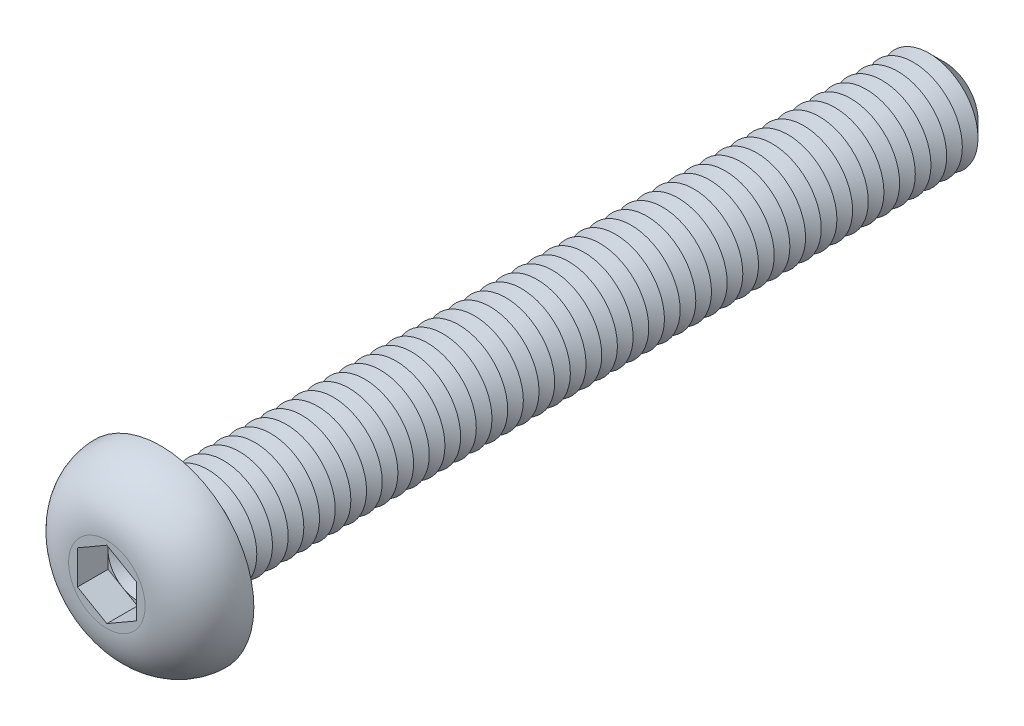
ISO-10303-21;
HEADER;
FILE_DESCRIPTION(('STEP AP214'),'2;1');
FILE_NAME('part.step','',(''),(''),'','','');
FILE_SCHEMA(('AUTOMOTIVE_DESIGN { 1 0 10303 214 1 1 1 1 }'));
ENDSEC;
DATA;
#1=APPLICATION_CONTEXT('core data for automotive mechanical design processes');
#2=APPLICATION_PROTOCOL_DEFINITION('international standard','automotive_design',2000,#1);
#3=PRODUCT_CONTEXT('',#1,'mechanical');
#4=PRODUCT('Part','Part','',(#3));
#5=PRODUCT_RELATED_PRODUCT_CATEGORY('part','',(#4));
#6=PRODUCT_DEFINITION_FORMATION('','',#4);
#7=PRODUCT_DEFINITION_CONTEXT('part definition',#1,'design');
#8=PRODUCT_DEFINITION('design','',#6,#7);
#9=PRODUCT_DEFINITION_SHAPE('','',#8);
#10=(LENGTH_UNIT() NAMED_UNIT(*) SI_UNIT(.MILLI.,.METRE.));
#11=(NAMED_UNIT(*) PLANE_ANGLE_UNIT() SI_UNIT($,.RADIAN.));
#12=(NAMED_UNIT(*) SI_UNIT($,.STERADIAN.) SOLID_ANGLE_UNIT());
#13=UNCERTAINTY_MEASURE_WITH_UNIT(LENGTH_MEASURE(1.E-05),#10,'distance_accuracy_value','');
#14=(GEOMETRIC_REPRESENTATION_CONTEXT(3) GLOBAL_UNCERTAINTY_ASSIGNED_CONTEXT((#13)) GLOBAL_UNIT_ASSIGNED_CONTEXT((#10,
#11,#12)) REPRESENTATION_CONTEXT('',''));
#15=CARTESIAN_POINT('',(0.,0.,0.));
#16=DIRECTION('',(0.,0.,1.));
#17=DIRECTION('',(1.,0.,0.));
#18=AXIS2_PLACEMENT_3D('',#15,#16,#17);
#19=CARTESIAN_POINT('',(0.,0.,1.19));
#20=DIRECTION('',(0.,0.,1.));
#21=DIRECTION('',(1.,0.,0.));
#22=AXIS2_PLACEMENT_3D('',#19,#20,#21);
#23=PLANE('',#22);
#24=CARTESIAN_POINT('',(0.,0.,1.19));
#25=DIRECTION('',(0.,0.,1.));
#26=DIRECTION('',(1.,0.,0.));
#27=AXIS2_PLACEMENT_3D('',#24,#25,#26);
#28=CIRCLE('',#27,1.5);
#29=CARTESIAN_POINT('',(1.5,0.,1.19));
#30=VERTEX_POINT('',#29);
#31=CARTESIAN_POINT('',(0.75,1.29903810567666,1.19));
#32=VERTEX_POINT('',#31);
#33=EDGE_CURVE('E117',#30,#32,#28,.T.);
#34=ORIENTED_EDGE('',*,*,#33,.F.);
#35=DIRECTION('',(0.,1.,0.));
#36=VECTOR('',#35,1.);
#37=CARTESIAN_POINT('',(1.5,-0.866025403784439,1.19));
#38=LINE('',#37,#36);
#39=CARTESIAN_POINT('',(1.5,0.86602540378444,1.19));
#40=VERTEX_POINT('',#39);
#41=EDGE_CURVE('E140',#30,#40,#38,.T.);
#42=ORIENTED_EDGE('',*,*,#41,.T.);
#43=DIRECTION('',(-0.866025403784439,0.5,0.));
#44=VECTOR('',#43,1.);
#45=CARTESIAN_POINT('',(1.5,0.86602540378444,1.19));
#46=LINE('',#45,#44);
#47=EDGE_CURVE('E135',#40,#32,#46,.T.);
#48=ORIENTED_EDGE('',*,*,#47,.T.);
#49=EDGE_LOOP('',(#34,#42,#48));
#50=FACE_BOUND('',#49,.T.);
#51=ADVANCED_FACE('F39',(#50),#23,.T.);
#52=CARTESIAN_POINT('',(0.,0.,1.19));
#53=DIRECTION('',(0.,0.,1.));
#54=DIRECTION('',(1.,0.,0.));
#55=AXIS2_PLACEMENT_3D('',#52,#53,#54);
#56=CIRCLE('',#55,1.5);
#57=CARTESIAN_POINT('',(-0.75,1.29903810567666,1.19));
#58=VERTEX_POINT('',#57);
#59=EDGE_CURVE('E11',#32,#58,#56,.T.);
#60=ORIENTED_EDGE('',*,*,#59,.F.);
#61=CARTESIAN_POINT('',(0.,1.73205080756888,1.19));
#62=VERTEX_POINT('',#61);
#63=EDGE_CURVE('E130',#32,#62,#46,.T.);
#64=ORIENTED_EDGE('',*,*,#63,.T.);
#65=DIRECTION('',(-0.866025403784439,-0.5,0.));
#66=VECTOR('',#65,1.);
#67=CARTESIAN_POINT('',(0.,1.73205080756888,1.19));
#68=LINE('',#67,#66);
#69=EDGE_CURVE('E132',#62,#58,#68,.T.);
#70=ORIENTED_EDGE('',*,*,#69,.T.);
#71=EDGE_LOOP('',(#60,#64,#70));
#72=FACE_BOUND('',#71,.T.);
#73=ADVANCED_FACE('F129',(#72),#23,.T.);
#74=CARTESIAN_POINT('',(-1.5,0.,1.19));
#75=VERTEX_POINT('',#74);
#76=EDGE_CURVE('E49',#58,#75,#56,.T.);
#77=ORIENTED_EDGE('',*,*,#76,.F.);
#78=CARTESIAN_POINT('',(-1.5,0.866025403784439,1.19));
#79=VERTEX_POINT('',#78);
#80=EDGE_CURVE('E143',#58,#79,#68,.T.);
#81=ORIENTED_EDGE('',*,*,#80,.T.);
#82=DIRECTION('',(0.,-1.,0.));
#83=VECTOR('',#82,1.);
#84=CARTESIAN_POINT('',(-1.5,0.866025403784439,1.19));
#85=LINE('',#84,#83);
#86=EDGE_CURVE('E154',#79,#75,#85,.T.);
#87=ORIENTED_EDGE('',*,*,#86,.T.);
#88=EDGE_LOOP('',(#77,#81,#87));
#89=FACE_BOUND('',#88,.T.);
#90=ADVANCED_FACE('F251',(#89),#23,.T.);
#91=CARTESIAN_POINT('',(-0.75,-1.29903810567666,1.19));
#92=VERTEX_POINT('',#91);
#93=EDGE_CURVE('E232',#75,#92,#56,.T.);
#94=ORIENTED_EDGE('',*,*,#93,.F.);
#95=CARTESIAN_POINT('',(-1.5,-0.866025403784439,1.19));
#96=VERTEX_POINT('',#95);
#97=EDGE_CURVE('E153',#75,#96,#85,.T.);
#98=ORIENTED_EDGE('',*,*,#97,.T.);
#99=DIRECTION('',(0.866025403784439,-0.5,0.));
#100=VECTOR('',#99,1.);
#101=CARTESIAN_POINT('',(-1.5,-0.866025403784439,1.19));
#102=LINE('',#101,#100);
#103=EDGE_CURVE('E159',#96,#92,#102,.T.);
#104=ORIENTED_EDGE('',*,*,#103,.T.);
#105=EDGE_LOOP('',(#94,#98,#104));
#106=FACE_BOUND('',#105,.T.);
#107=ADVANCED_FACE('F244',(#106),#23,.T.);
#108=CARTESIAN_POINT('',(0.75,-1.29903810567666,1.19));
#109=VERTEX_POINT('',#108);
#110=EDGE_CURVE('E56',#92,#109,#56,.T.);
#111=ORIENTED_EDGE('',*,*,#110,.F.);
#112=CARTESIAN_POINT('',(0.,-1.73205080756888,1.19));
#113=VERTEX_POINT('',#112);
#114=EDGE_CURVE('E158',#92,#113,#102,.T.);
#115=ORIENTED_EDGE('',*,*,#114,.T.);
#116=DIRECTION('',(0.866025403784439,0.5,0.));
#117=VECTOR('',#116,1.);
#118=CARTESIAN_POINT('',(0.,-1.73205080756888,1.19));
#119=LINE('',#118,#117);
#120=EDGE_CURVE('E164',#113,#109,#119,.T.);
#121=ORIENTED_EDGE('',*,*,#120,.T.);
#122=EDGE_LOOP('',(#111,#115,#121));
#123=FACE_BOUND('',#122,.T.);
#124=ADVANCED_FACE('F647',(#123),#23,.T.);
#125=CARTESIAN_POINT('',(0.,0.,-40.));
#126=DIRECTION('',(0.,0.,1.));
#127=DIRECTION('',(1.,0.,0.));
#128=AXIS2_PLACEMENT_3D('',#125,#126,#127);
#129=CYLINDRICAL_SURFACE('',#128,2.5);
#130=CARTESIAN_POINT('',(0.,0.,-0.399999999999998));
#131=DIRECTION('',(0.,0.,1.));
#132=DIRECTION('',(1.,0.,0.));
#133=AXIS2_PLACEMENT_3D('',#130,#131,#132);
#134=CIRCLE('',#133,2.5);
#135=CARTESIAN_POINT('',(2.5,0.,-0.399999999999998));
#136=VERTEX_POINT('',#135);
#137=EDGE_CURVE('E221',#136,#136,#134,.F.);
#138=ORIENTED_EDGE('',*,*,#137,.T.);
#139=EDGE_LOOP('',(#138));
#140=FACE_BOUND('',#139,.T.);
#141=CARTESIAN_POINT('',(0.,0.,-0.800000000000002));
#142=DIRECTION('',(0.,0.,1.));
#143=DIRECTION('',(1.,0.,0.));
#144=AXIS2_PLACEMENT_3D('',#141,#142,#143);
#145=CIRCLE('',#144,2.5);
#146=CARTESIAN_POINT('',(2.5,0.,-0.800000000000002));
#147=VERTEX_POINT('',#146);
#148=EDGE_CURVE('E149',#147,#147,#145,.T.);
#149=ORIENTED_EDGE('',*,*,#148,.T.);
#150=EDGE_LOOP('',(#149));
#151=FACE_BOUND('',#150,.T.);
#152=ADVANCED_FACE('F631',(#140,#151),#129,.T.);
#153=CARTESIAN_POINT('',(0.,4.75,0.));
#154=DIRECTION('',(0.,0.,1.));
#155=DIRECTION('',(1.,0.,0.));
#156=AXIS2_PLACEMENT_3D('',#153,#154,#155);
#157=PLANE('',#156);
#158=CARTESIAN_POINT('',(0.,0.,0.));
#159=DIRECTION('',(0.,0.,1.));
#160=DIRECTION('',(1.,0.,0.));
#161=AXIS2_PLACEMENT_3D('',#158,#159,#160);
#162=CIRCLE('',#161,2.9);
#163=CARTESIAN_POINT('',(2.9,0.,0.));
#164=VERTEX_POINT('',#163);
#165=EDGE_CURVE('E224',#164,#164,#162,.T.);
#166=ORIENTED_EDGE('',*,*,#165,.T.);
#167=EDGE_LOOP('',(#166));
#168=FACE_BOUND('',#167,.T.);
#169=CARTESIAN_POINT('',(0.,0.,0.));
#170=DIRECTION('',(0.,0.,1.));
#171=DIRECTION('',(1.,0.,0.));
#172=AXIS2_PLACEMENT_3D('',#169,#170,#171);
#173=CIRCLE('',#172,4.75);
#174=CARTESIAN_POINT('',(4.75,0.,0.));
#175=VERTEX_POINT('',#174);
#176=EDGE_CURVE('E196',#175,#175,#173,.T.);
#177=ORIENTED_EDGE('',*,*,#176,.F.);
#178=EDGE_LOOP('',(#177));
#179=FACE_BOUND('',#178,.T.);
#180=ADVANCED_FACE('F677',(#168,#179),#157,.F.);
#181=CARTESIAN_POINT('',(0.,0.,2.75));
#182=DIRECTION('',(0.,0.,-1.));
#183=DIRECTION('',(-1.,0.,0.));
#184=AXIS2_PLACEMENT_3D('',#181,#182,#183);
#185=PLANE('',#184);
#186=DIRECTION('',(-0.866025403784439,-0.5,0.));
#187=VECTOR('',#186,1.);
#188=CARTESIAN_POINT('',(0.,1.73205080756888,2.75));
#189=LINE('',#188,#187);
#190=CARTESIAN_POINT('',(0.,1.73205080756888,2.75));
#191=VERTEX_POINT('',#190);
#192=CARTESIAN_POINT('',(-1.5,0.866025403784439,2.75));
#193=VERTEX_POINT('',#192);
#194=EDGE_CURVE('E174',#191,#193,#189,.T.);
#195=ORIENTED_EDGE('',*,*,#194,.F.);
#196=DIRECTION('',(-0.866025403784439,0.5,0.));
#197=VECTOR('',#196,1.);
#198=CARTESIAN_POINT('',(1.5,0.86602540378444,2.75));
#199=LINE('',#198,#197);
#200=CARTESIAN_POINT('',(1.5,0.86602540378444,2.75));
#201=VERTEX_POINT('',#200);
#202=EDGE_CURVE('E64',#201,#191,#199,.T.);
#203=ORIENTED_EDGE('',*,*,#202,.F.);
#204=DIRECTION('',(0.,1.,0.));
#205=VECTOR('',#204,1.);
#206=CARTESIAN_POINT('',(1.5,-0.866025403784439,2.75));
#207=LINE('',#206,#205);
#208=CARTESIAN_POINT('',(1.5,-0.866025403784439,2.75));
#209=VERTEX_POINT('',#208);
#210=EDGE_CURVE('E138',#209,#201,#207,.T.);
#211=ORIENTED_EDGE('',*,*,#210,.F.);
#212=DIRECTION('',(0.866025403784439,0.5,0.));
#213=VECTOR('',#212,1.);
#214=CARTESIAN_POINT('',(0.,-1.73205080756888,2.75));
#215=LINE('',#214,#213);
#216=CARTESIAN_POINT('',(0.,-1.73205080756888,2.75));
#217=VERTEX_POINT('',#216);
#218=EDGE_CURVE('E186',#217,#209,#215,.T.);
#219=ORIENTED_EDGE('',*,*,#218,.F.);
#220=DIRECTION('',(0.866025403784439,-0.5,0.));
#221=VECTOR('',#220,1.);
#222=CARTESIAN_POINT('',(-1.5,-0.866025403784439,2.75));
#223=LINE('',#222,#221);
#224=CARTESIAN_POINT('',(-1.5,-0.866025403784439,2.75));
#225=VERTEX_POINT('',#224);
#226=EDGE_CURVE('E182',#225,#217,#223,.T.);
#227=ORIENTED_EDGE('',*,*,#226,.F.);
#228=DIRECTION('',(0.,-1.,0.));
#229=VECTOR('',#228,1.);
#230=CARTESIAN_POINT('',(-1.5,0.866025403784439,2.75));
#231=LINE('',#230,#229);
#232=EDGE_CURVE('E178',#193,#225,#231,.T.);
#233=ORIENTED_EDGE('',*,*,#232,.F.);
#234=EDGE_LOOP('',(#195,#203,#211,#219,#227,#233));
#235=FACE_BOUND('',#234,.T.);
#236=CARTESIAN_POINT('',(0.,0.,2.75));
#237=DIRECTION('',(0.,0.,1.));
#238=DIRECTION('',(1.,0.,0.));
#239=AXIS2_PLACEMENT_3D('',#236,#237,#238);
#240=CIRCLE('',#239,1.95044646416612);
#241=CARTESIAN_POINT('',(1.95044646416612,0.,2.75));
#242=VERTEX_POINT('',#241);
#243=EDGE_CURVE('E214',#242,#242,#240,.T.);
#244=ORIENTED_EDGE('',*,*,#243,.T.);
#245=EDGE_LOOP('',(#244));
#246=FACE_BOUND('',#245,.T.);
#247=ADVANCED_FACE('F260',(#235,#246),#185,.F.);
#248=CARTESIAN_POINT('',(0.,0.,-0.0500000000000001));
#249=DIRECTION('',(0.,0.,1.));
#250=DIRECTION('',(1.,0.,0.));
#251=AXIS2_PLACEMENT_3D('',#248,#249,#250);
#252=DEGENERATE_TOROIDAL_SURFACE('',#251,1.95044646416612,2.8,.T.);
#253=ORIENTED_EDGE('',*,*,#243,.F.);
#254=EDGE_LOOP('',(#253));
#255=FACE_BOUND('',#254,.T.);
#256=ORIENTED_EDGE('',*,*,#176,.T.);
#257=EDGE_LOOP('',(#256));
#258=FACE_BOUND('',#257,.T.);
#259=ADVANCED_FACE('F671',(#255,#258),#252,.T.);
#260=CARTESIAN_POINT('',(1.5,0.86602540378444,1.19));
#261=DIRECTION('',(0.5,0.866025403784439,0.));
#262=DIRECTION('',(-0.866025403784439,0.5,0.));
#263=AXIS2_PLACEMENT_3D('',#260,#261,#262);
#264=PLANE('',#263);
#265=ORIENTED_EDGE('',*,*,#202,.T.);
#266=DIRECTION('',(0.,0.,1.));
#267=VECTOR('',#266,1.);
#268=CARTESIAN_POINT('',(0.,1.73205080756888,1.19));
#269=LINE('',#268,#267);
#270=EDGE_CURVE('E136',#62,#191,#269,.T.);
#271=ORIENTED_EDGE('',*,*,#270,.F.);
#272=ORIENTED_EDGE('',*,*,#63,.F.);
#273=ORIENTED_EDGE('',*,*,#47,.F.);
#274=DIRECTION('',(0.,0.,1.));
#275=VECTOR('',#274,1.);
#276=CARTESIAN_POINT('',(1.5,0.86602540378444,1.19));
#277=LINE('',#276,#275);
#278=EDGE_CURVE('E193',#40,#201,#277,.T.);
#279=ORIENTED_EDGE('',*,*,#278,.T.);
#280=EDGE_LOOP('',(#265,#271,#272,#273,#279));
#281=FACE_BOUND('',#280,.T.);
#282=ADVANCED_FACE('F134',(#281),#264,.F.);
#283=CARTESIAN_POINT('',(1.5,-0.866025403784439,1.19));
#284=DIRECTION('',(1.,0.,0.));
#285=DIRECTION('',(0.,1.,0.));
#286=AXIS2_PLACEMENT_3D('',#283,#284,#285);
#287=PLANE('',#286);
#288=ORIENTED_EDGE('',*,*,#210,.T.);
#289=ORIENTED_EDGE('',*,*,#278,.F.);
#290=ORIENTED_EDGE('',*,*,#41,.F.);
#291=CARTESIAN_POINT('',(1.5,-0.866025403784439,1.19));
#292=VERTEX_POINT('',#291);
#293=EDGE_CURVE('E168',#292,#30,#38,.T.);
#294=ORIENTED_EDGE('',*,*,#293,.F.);
#295=DIRECTION('',(0.,0.,1.));
#296=VECTOR('',#295,1.);
#297=CARTESIAN_POINT('',(1.5,-0.866025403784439,1.19));
#298=LINE('',#297,#296);
#299=EDGE_CURVE('E197',#292,#209,#298,.T.);
#300=ORIENTED_EDGE('',*,*,#299,.T.);
#301=EDGE_LOOP('',(#288,#289,#290,#294,#300));
#302=FACE_BOUND('',#301,.T.);
#303=ADVANCED_FACE('F655',(#302),#287,.F.);
#304=CARTESIAN_POINT('',(0.,-1.73205080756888,1.19));
#305=DIRECTION('',(0.5,-0.866025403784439,0.));
#306=DIRECTION('',(0.866025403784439,0.5,0.));
#307=AXIS2_PLACEMENT_3D('',#304,#305,#306);
#308=PLANE('',#307);
#309=ORIENTED_EDGE('',*,*,#218,.T.);
#310=ORIENTED_EDGE('',*,*,#299,.F.);
#311=EDGE_CURVE('E163',#109,#292,#119,.T.);
#312=ORIENTED_EDGE('',*,*,#311,.F.);
#313=ORIENTED_EDGE('',*,*,#120,.F.);
#314=DIRECTION('',(0.,0.,1.));
#315=VECTOR('',#314,1.);
#316=CARTESIAN_POINT('',(0.,-1.73205080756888,1.19));
#317=LINE('',#316,#315);
#318=EDGE_CURVE('E200',#113,#217,#317,.T.);
#319=ORIENTED_EDGE('',*,*,#318,.T.);
#320=EDGE_LOOP('',(#309,#310,#312,#313,#319));
#321=FACE_BOUND('',#320,.T.);
#322=ADVANCED_FACE('F658',(#321),#308,.F.);
#323=CARTESIAN_POINT('',(-1.5,-0.866025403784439,1.19));
#324=DIRECTION('',(-0.5,-0.866025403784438,0.));
#325=DIRECTION('',(0.866025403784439,-0.5,0.));
#326=AXIS2_PLACEMENT_3D('',#323,#324,#325);
#327=PLANE('',#326);
#328=ORIENTED_EDGE('',*,*,#226,.T.);
#329=ORIENTED_EDGE('',*,*,#318,.F.);
#330=ORIENTED_EDGE('',*,*,#114,.F.);
#331=ORIENTED_EDGE('',*,*,#103,.F.);
#332=DIRECTION('',(0.,0.,1.));
#333=VECTOR('',#332,1.);
#334=CARTESIAN_POINT('',(-1.5,-0.866025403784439,1.19));
#335=LINE('',#334,#333);
#336=EDGE_CURVE('E203',#96,#225,#335,.T.);
#337=ORIENTED_EDGE('',*,*,#336,.T.);
#338=EDGE_LOOP('',(#328,#329,#330,#331,#337));
#339=FACE_BOUND('',#338,.T.);
#340=ADVANCED_FACE('F265',(#339),#327,.F.);
#341=CARTESIAN_POINT('',(-1.5,0.866025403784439,1.19));
#342=DIRECTION('',(-1.,0.,0.));
#343=DIRECTION('',(0.,-1.,0.));
#344=AXIS2_PLACEMENT_3D('',#341,#342,#343);
#345=PLANE('',#344);
#346=ORIENTED_EDGE('',*,*,#232,.T.);
#347=ORIENTED_EDGE('',*,*,#336,.F.);
#348=ORIENTED_EDGE('',*,*,#97,.F.);
#349=ORIENTED_EDGE('',*,*,#86,.F.);
#350=DIRECTION('',(0.,0.,1.));
#351=VECTOR('',#350,1.);
#352=CARTESIAN_POINT('',(-1.5,0.866025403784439,1.19));
#353=LINE('',#352,#351);
#354=EDGE_CURVE('E206',#79,#193,#353,.T.);
#355=ORIENTED_EDGE('',*,*,#354,.T.);
#356=EDGE_LOOP('',(#346,#347,#348,#349,#355));
#357=FACE_BOUND('',#356,.T.);
#358=ADVANCED_FACE('F249',(#357),#345,.F.);
#359=CARTESIAN_POINT('',(0.,1.73205080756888,1.19));
#360=DIRECTION('',(-0.5,0.866025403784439,0.));
#361=DIRECTION('',(-0.866025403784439,-0.5,0.));
#362=AXIS2_PLACEMENT_3D('',#359,#360,#361);
#363=PLANE('',#362);
#364=ORIENTED_EDGE('',*,*,#194,.T.);
#365=ORIENTED_EDGE('',*,*,#354,.F.);
#366=ORIENTED_EDGE('',*,*,#80,.F.);
#367=ORIENTED_EDGE('',*,*,#69,.F.);
#368=ORIENTED_EDGE('',*,*,#270,.T.);
#369=EDGE_LOOP('',(#364,#365,#366,#367,#368));
#370=FACE_BOUND('',#369,.T.);
#371=ADVANCED_FACE('F254',(#370),#363,.F.);
#372=EDGE_CURVE('E43',#109,#30,#56,.T.);
#373=ORIENTED_EDGE('',*,*,#372,.F.);
#374=ORIENTED_EDGE('',*,*,#311,.T.);
#375=ORIENTED_EDGE('',*,*,#293,.T.);
#376=EDGE_LOOP('',(#373,#374,#375));
#377=FACE_BOUND('',#376,.T.);
#378=ADVANCED_FACE('F636',(#377),#23,.T.);
#379=CARTESIAN_POINT('',(0.,0.,-0.800000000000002));
#380=DIRECTION('',(0.,0.,1.));
#381=DIRECTION('',(1.,0.,0.));
#382=AXIS2_PLACEMENT_3D('',#379,#380,#381);
#383=CONICAL_SURFACE('',#382,2.5,1.0471975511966);
#384=CARTESIAN_POINT('',(0.,0.,-1.2));
#385=DIRECTION('',(0.,0.,1.));
#386=DIRECTION('',(1.,0.,0.));
#387=AXIS2_PLACEMENT_3D('',#384,#385,#386);
#388=CIRCLE('',#387,1.80717967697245);
#389=CARTESIAN_POINT('',(1.80717967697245,0.,-1.2));
#390=VERTEX_POINT('',#389);
#391=EDGE_CURVE('E623',#390,#390,#388,.T.);
#392=ORIENTED_EDGE('',*,*,#391,.T.);
#393=EDGE_LOOP('',(#392));
#394=FACE_BOUND('',#393,.T.);
#395=ORIENTED_EDGE('',*,*,#148,.F.);
#396=EDGE_LOOP('',(#395));
#397=FACE_BOUND('',#396,.T.);
#398=ADVANCED_FACE('F633',(#394,#397),#383,.T.);
#399=CARTESIAN_POINT('',(0.,0.,-1.2));
#400=DIRECTION('',(0.,0.,-1.));
#401=DIRECTION('',(-1.,0.,0.));
#402=AXIS2_PLACEMENT_3D('',#399,#400,#401);
#403=CONICAL_SURFACE('',#402,1.80717967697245,1.04719755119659);
#404=CARTESIAN_POINT('',(0.,0.,-1.6));
#405=DIRECTION('',(0.,0.,1.));
#406=DIRECTION('',(1.,0.,0.));
#407=AXIS2_PLACEMENT_3D('',#404,#405,#406);
#408=CIRCLE('',#407,2.5);
#409=CARTESIAN_POINT('',(2.5,0.,-1.6));
#410=VERTEX_POINT('',#409);
#411=EDGE_CURVE('E620',#410,#410,#408,.T.);
#412=ORIENTED_EDGE('',*,*,#411,.T.);
#413=EDGE_LOOP('',(#412));
#414=FACE_BOUND('',#413,.T.);
#415=ORIENTED_EDGE('',*,*,#391,.F.);
#416=EDGE_LOOP('',(#415));
#417=FACE_BOUND('',#416,.T.);
#418=ADVANCED_FACE('F635',(#414,#417),#403,.T.);
#419=CARTESIAN_POINT('',(0.,0.,-1.6));
#420=DIRECTION('',(0.,0.,1.));
#421=DIRECTION('',(1.,0.,0.));
#422=AXIS2_PLACEMENT_3D('',#419,#420,#421);
#423=CONICAL_SURFACE('',#422,2.5,1.0471975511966);
#424=CARTESIAN_POINT('',(0.,0.,-2.));
#425=DIRECTION('',(0.,0.,1.));
#426=DIRECTION('',(1.,0.,0.));
#427=AXIS2_PLACEMENT_3D('',#424,#425,#426);
#428=CIRCLE('',#427,1.80717967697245);
#429=CARTESIAN_POINT('',(1.80717967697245,0.,-2.));
#430=VERTEX_POINT('',#429);
#431=EDGE_CURVE('E616',#430,#430,#428,.T.);
#432=ORIENTED_EDGE('',*,*,#431,.T.);
#433=EDGE_LOOP('',(#432));
#434=FACE_BOUND('',#433,.T.);
#435=ORIENTED_EDGE('',*,*,#411,.F.);
#436=EDGE_LOOP('',(#435));
#437=FACE_BOUND('',#436,.T.);
#438=ADVANCED_FACE('F642',(#434,#437),#423,.T.);
#439=CARTESIAN_POINT('',(0.,0.,-2.));
#440=DIRECTION('',(0.,0.,-1.));
#441=DIRECTION('',(-1.,0.,0.));
#442=AXIS2_PLACEMENT_3D('',#439,#440,#441);
#443=CONICAL_SURFACE('',#442,1.80717967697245,1.04719755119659);
#444=CARTESIAN_POINT('',(0.,0.,-2.4));
#445=DIRECTION('',(0.,0.,1.));
#446=DIRECTION('',(1.,0.,0.));
#447=AXIS2_PLACEMENT_3D('',#444,#445,#446);
#448=CIRCLE('',#447,2.5);
#449=CARTESIAN_POINT('',(2.5,0.,-2.4));
#450=VERTEX_POINT('',#449);
#451=EDGE_CURVE('E612',#450,#450,#448,.T.);
#452=ORIENTED_EDGE('',*,*,#451,.T.);
#453=EDGE_LOOP('',(#452));
#454=FACE_BOUND('',#453,.T.);
#455=ORIENTED_EDGE('',*,*,#431,.F.);
#456=EDGE_LOOP('',(#455));
#457=FACE_BOUND('',#456,.T.);
#458=ADVANCED_FACE('F1075',(#454,#457),#443,.T.);
#459=CARTESIAN_POINT('',(0.,0.,-2.4));
#460=DIRECTION('',(0.,0.,1.));
#461=DIRECTION('',(1.,0.,0.));
#462=AXIS2_PLACEMENT_3D('',#459,#460,#461);
#463=CONICAL_SURFACE('',#462,2.5,1.0471975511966);
#464=CARTESIAN_POINT('',(0.,0.,-2.8));
#465=DIRECTION('',(0.,0.,1.));
#466=DIRECTION('',(1.,0.,0.));
#467=AXIS2_PLACEMENT_3D('',#464,#465,#466);
#468=CIRCLE('',#467,1.80717967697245);
#469=CARTESIAN_POINT('',(1.80717967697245,0.,-2.8));
#470=VERTEX_POINT('',#469);
#471=EDGE_CURVE('E273',#470,#470,#468,.T.);
#472=ORIENTED_EDGE('',*,*,#471,.T.);
#473=EDGE_LOOP('',(#472));
#474=FACE_BOUND('',#473,.T.);
#475=ORIENTED_EDGE('',*,*,#451,.F.);
#476=EDGE_LOOP('',(#475));
#477=FACE_BOUND('',#476,.T.);
#478=ADVANCED_FACE('F1071',(#474,#477),#463,.T.);
#479=CARTESIAN_POINT('',(0.,0.,-2.8));
#480=DIRECTION('',(0.,0.,-1.));
#481=DIRECTION('',(-1.,0.,0.));
#482=AXIS2_PLACEMENT_3D('',#479,#480,#481);
#483=CONICAL_SURFACE('',#482,1.80717967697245,1.04719755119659);
#484=CARTESIAN_POINT('',(0.,0.,-3.2));
#485=DIRECTION('',(0.,0.,1.));
#486=DIRECTION('',(1.,0.,0.));
#487=AXIS2_PLACEMENT_3D('',#484,#485,#486);
#488=CIRCLE('',#487,2.5);
#489=CARTESIAN_POINT('',(2.5,0.,-3.2));
#490=VERTEX_POINT('',#489);
#491=EDGE_CURVE('E270',#490,#490,#488,.T.);
#492=ORIENTED_EDGE('',*,*,#491,.T.);
#493=EDGE_LOOP('',(#492));
#494=FACE_BOUND('',#493,.T.);
#495=ORIENTED_EDGE('',*,*,#471,.F.);
#496=EDGE_LOOP('',(#495));
#497=FACE_BOUND('',#496,.T.);
#498=ADVANCED_FACE('F1067',(#494,#497),#483,.T.);
#499=CARTESIAN_POINT('',(0.,0.,-3.2));
#500=DIRECTION('',(0.,0.,1.));
#501=DIRECTION('',(1.,0.,0.));
#502=AXIS2_PLACEMENT_3D('',#499,#500,#501);
#503=CONICAL_SURFACE('',#502,2.5,1.0471975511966);
#504=CARTESIAN_POINT('',(0.,0.,-3.6));
#505=DIRECTION('',(0.,0.,1.));
#506=DIRECTION('',(1.,0.,0.));
#507=AXIS2_PLACEMENT_3D('',#504,#505,#506);
#508=CIRCLE('',#507,1.80717967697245);
#509=CARTESIAN_POINT('',(1.80717967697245,0.,-3.6));
#510=VERTEX_POINT('',#509);
#511=EDGE_CURVE('E274',#510,#510,#508,.T.);
#512=ORIENTED_EDGE('',*,*,#511,.T.);
#513=EDGE_LOOP('',(#512));
#514=FACE_BOUND('',#513,.T.);
#515=ORIENTED_EDGE('',*,*,#491,.F.);
#516=EDGE_LOOP('',(#515));
#517=FACE_BOUND('',#516,.T.);
#518=ADVANCED_FACE('F1063',(#514,#517),#503,.T.);
#519=CARTESIAN_POINT('',(0.,0.,-3.6));
#520=DIRECTION('',(0.,0.,-1.));
#521=DIRECTION('',(-1.,0.,0.));
#522=AXIS2_PLACEMENT_3D('',#519,#520,#521);
#523=CONICAL_SURFACE('',#522,1.80717967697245,1.04719755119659);
#524=CARTESIAN_POINT('',(0.,0.,-4.));
#525=DIRECTION('',(0.,0.,1.));
#526=DIRECTION('',(1.,0.,0.));
#527=AXIS2_PLACEMENT_3D('',#524,#525,#526);
#528=CIRCLE('',#527,2.5);
#529=CARTESIAN_POINT('',(2.5,0.,-4.));
#530=VERTEX_POINT('',#529);
#531=EDGE_CURVE('E602',#530,#530,#528,.T.);
#532=ORIENTED_EDGE('',*,*,#531,.T.);
#533=EDGE_LOOP('',(#532));
#534=FACE_BOUND('',#533,.T.);
#535=ORIENTED_EDGE('',*,*,#511,.F.);
#536=EDGE_LOOP('',(#535));
#537=FACE_BOUND('',#536,.T.);
#538=ADVANCED_FACE('F1059',(#534,#537),#523,.T.);
#539=CARTESIAN_POINT('',(0.,0.,-4.));
#540=DIRECTION('',(0.,0.,1.));
#541=DIRECTION('',(1.,0.,0.));
#542=AXIS2_PLACEMENT_3D('',#539,#540,#541);
#543=CONICAL_SURFACE('',#542,2.5,1.0471975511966);
#544=CARTESIAN_POINT('',(0.,0.,-4.4));
#545=DIRECTION('',(0.,0.,1.));
#546=DIRECTION('',(1.,0.,0.));
#547=AXIS2_PLACEMENT_3D('',#544,#545,#546);
#548=CIRCLE('',#547,1.80717967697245);
#549=CARTESIAN_POINT('',(1.80717967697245,0.,-4.4));
#550=VERTEX_POINT('',#549);
#551=EDGE_CURVE('E599',#550,#550,#548,.T.);
#552=ORIENTED_EDGE('',*,*,#551,.T.);
#553=EDGE_LOOP('',(#552));
#554=FACE_BOUND('',#553,.T.);
#555=ORIENTED_EDGE('',*,*,#531,.F.);
#556=EDGE_LOOP('',(#555));
#557=FACE_BOUND('',#556,.T.);
#558=ADVANCED_FACE('F1055',(#554,#557),#543,.T.);
#559=CARTESIAN_POINT('',(0.,0.,-4.4));
#560=DIRECTION('',(0.,0.,-1.));
#561=DIRECTION('',(-1.,0.,0.));
#562=AXIS2_PLACEMENT_3D('',#559,#560,#561);
#563=CONICAL_SURFACE('',#562,1.80717967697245,1.04719755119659);
#564=CARTESIAN_POINT('',(0.,0.,-4.8));
#565=DIRECTION('',(0.,0.,1.));
#566=DIRECTION('',(1.,0.,0.));
#567=AXIS2_PLACEMENT_3D('',#564,#565,#566);
#568=CIRCLE('',#567,2.5);
#569=CARTESIAN_POINT('',(2.5,0.,-4.8));
#570=VERTEX_POINT('',#569);
#571=EDGE_CURVE('E595',#570,#570,#568,.T.);
#572=ORIENTED_EDGE('',*,*,#571,.T.);
#573=EDGE_LOOP('',(#572));
#574=FACE_BOUND('',#573,.T.);
#575=ORIENTED_EDGE('',*,*,#551,.F.);
#576=EDGE_LOOP('',(#575));
#577=FACE_BOUND('',#576,.T.);
#578=ADVANCED_FACE('F1051',(#574,#577),#563,.T.);
#579=CARTESIAN_POINT('',(0.,0.,-4.8));
#580=DIRECTION('',(0.,0.,1.));
#581=DIRECTION('',(1.,0.,0.));
#582=AXIS2_PLACEMENT_3D('',#579,#580,#581);
#583=CONICAL_SURFACE('',#582,2.5,1.0471975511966);
#584=CARTESIAN_POINT('',(0.,0.,-5.2));
#585=DIRECTION('',(0.,0.,1.));
#586=DIRECTION('',(1.,0.,0.));
#587=AXIS2_PLACEMENT_3D('',#584,#585,#586);
#588=CIRCLE('',#587,1.80717967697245);
#589=CARTESIAN_POINT('',(1.80717967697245,0.,-5.2));
#590=VERTEX_POINT('',#589);
#591=EDGE_CURVE('E591',#590,#590,#588,.T.);
#592=ORIENTED_EDGE('',*,*,#591,.T.);
#593=EDGE_LOOP('',(#592));
#594=FACE_BOUND('',#593,.T.);
#595=ORIENTED_EDGE('',*,*,#571,.F.);
#596=EDGE_LOOP('',(#595));
#597=FACE_BOUND('',#596,.T.);
#598=ADVANCED_FACE('F1047',(#594,#597),#583,.T.);
#599=CARTESIAN_POINT('',(0.,0.,-5.2));
#600=DIRECTION('',(0.,0.,-1.));
#601=DIRECTION('',(-1.,0.,0.));
#602=AXIS2_PLACEMENT_3D('',#599,#600,#601);
#603=CONICAL_SURFACE('',#602,1.80717967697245,1.04719755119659);
#604=CARTESIAN_POINT('',(0.,0.,-5.6));
#605=DIRECTION('',(0.,0.,1.));
#606=DIRECTION('',(1.,0.,0.));
#607=AXIS2_PLACEMENT_3D('',#604,#605,#606);
#608=CIRCLE('',#607,2.5);
#609=CARTESIAN_POINT('',(2.5,0.,-5.6));
#610=VERTEX_POINT('',#609);
#611=EDGE_CURVE('E587',#610,#610,#608,.T.);
#612=ORIENTED_EDGE('',*,*,#611,.T.);
#613=EDGE_LOOP('',(#612));
#614=FACE_BOUND('',#613,.T.);
#615=ORIENTED_EDGE('',*,*,#591,.F.);
#616=EDGE_LOOP('',(#615));
#617=FACE_BOUND('',#616,.T.);
#618=ADVANCED_FACE('F1043',(#614,#617),#603,.T.);
#619=CARTESIAN_POINT('',(0.,0.,-5.6));
#620=DIRECTION('',(0.,0.,1.));
#621=DIRECTION('',(1.,0.,0.));
#622=AXIS2_PLACEMENT_3D('',#619,#620,#621);
#623=CONICAL_SURFACE('',#622,2.5,1.0471975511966);
#624=CARTESIAN_POINT('',(0.,0.,-6.));
#625=DIRECTION('',(0.,0.,1.));
#626=DIRECTION('',(1.,0.,0.));
#627=AXIS2_PLACEMENT_3D('',#624,#625,#626);
#628=CIRCLE('',#627,1.80717967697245);
#629=CARTESIAN_POINT('',(1.80717967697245,0.,-6.));
#630=VERTEX_POINT('',#629);
#631=EDGE_CURVE('E583',#630,#630,#628,.T.);
#632=ORIENTED_EDGE('',*,*,#631,.T.);
#633=EDGE_LOOP('',(#632));
#634=FACE_BOUND('',#633,.T.);
#635=ORIENTED_EDGE('',*,*,#611,.F.);
#636=EDGE_LOOP('',(#635));
#637=FACE_BOUND('',#636,.T.);
#638=ADVANCED_FACE('F1039',(#634,#637),#623,.T.);
#639=CARTESIAN_POINT('',(0.,0.,-6.));
#640=DIRECTION('',(0.,0.,-1.));
#641=DIRECTION('',(-1.,0.,0.));
#642=AXIS2_PLACEMENT_3D('',#639,#640,#641);
#643=CONICAL_SURFACE('',#642,1.80717967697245,1.04719755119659);
#644=CARTESIAN_POINT('',(0.,0.,-6.4));
#645=DIRECTION('',(0.,0.,1.));
#646=DIRECTION('',(1.,0.,0.));
#647=AXIS2_PLACEMENT_3D('',#644,#645,#646);
#648=CIRCLE('',#647,2.5);
#649=CARTESIAN_POINT('',(2.5,0.,-6.4));
#650=VERTEX_POINT('',#649);
#651=EDGE_CURVE('E579',#650,#650,#648,.T.);
#652=ORIENTED_EDGE('',*,*,#651,.T.);
#653=EDGE_LOOP('',(#652));
#654=FACE_BOUND('',#653,.T.);
#655=ORIENTED_EDGE('',*,*,#631,.F.);
#656=EDGE_LOOP('',(#655));
#657=FACE_BOUND('',#656,.T.);
#658=ADVANCED_FACE('F1035',(#654,#657),#643,.T.);
#659=CARTESIAN_POINT('',(0.,0.,-6.4));
#660=DIRECTION('',(0.,0.,1.));
#661=DIRECTION('',(1.,0.,0.));
#662=AXIS2_PLACEMENT_3D('',#659,#660,#661);
#663=CONICAL_SURFACE('',#662,2.5,1.0471975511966);
#664=CARTESIAN_POINT('',(0.,0.,-6.8));
#665=DIRECTION('',(0.,0.,1.));
#666=DIRECTION('',(1.,0.,0.));
#667=AXIS2_PLACEMENT_3D('',#664,#665,#666);
#668=CIRCLE('',#667,1.80717967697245);
#669=CARTESIAN_POINT('',(1.80717967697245,0.,-6.8));
#670=VERTEX_POINT('',#669);
#671=EDGE_CURVE('E575',#670,#670,#668,.T.);
#672=ORIENTED_EDGE('',*,*,#671,.T.);
#673=EDGE_LOOP('',(#672));
#674=FACE_BOUND('',#673,.T.);
#675=ORIENTED_EDGE('',*,*,#651,.F.);
#676=EDGE_LOOP('',(#675));
#677=FACE_BOUND('',#676,.T.);
#678=ADVANCED_FACE('F1031',(#674,#677),#663,.T.);
#679=CARTESIAN_POINT('',(0.,0.,-6.8));
#680=DIRECTION('',(0.,0.,-1.));
#681=DIRECTION('',(-1.,0.,0.));
#682=AXIS2_PLACEMENT_3D('',#679,#680,#681);
#683=CONICAL_SURFACE('',#682,1.80717967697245,1.04719755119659);
#684=CARTESIAN_POINT('',(0.,0.,-7.2));
#685=DIRECTION('',(0.,0.,1.));
#686=DIRECTION('',(1.,0.,0.));
#687=AXIS2_PLACEMENT_3D('',#684,#685,#686);
#688=CIRCLE('',#687,2.5);
#689=CARTESIAN_POINT('',(2.5,0.,-7.2));
#690=VERTEX_POINT('',#689);
#691=EDGE_CURVE('E571',#690,#690,#688,.T.);
#692=ORIENTED_EDGE('',*,*,#691,.T.);
#693=EDGE_LOOP('',(#692));
#694=FACE_BOUND('',#693,.T.);
#695=ORIENTED_EDGE('',*,*,#671,.F.);
#696=EDGE_LOOP('',(#695));
#697=FACE_BOUND('',#696,.T.);
#698=ADVANCED_FACE('F1027',(#694,#697),#683,.T.);
#699=CARTESIAN_POINT('',(0.,0.,-7.2));
#700=DIRECTION('',(0.,0.,1.));
#701=DIRECTION('',(1.,0.,0.));
#702=AXIS2_PLACEMENT_3D('',#699,#700,#701);
#703=CONICAL_SURFACE('',#702,2.5,1.0471975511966);
#704=CARTESIAN_POINT('',(0.,0.,-7.6));
#705=DIRECTION('',(0.,0.,1.));
#706=DIRECTION('',(1.,0.,0.));
#707=AXIS2_PLACEMENT_3D('',#704,#705,#706);
#708=CIRCLE('',#707,1.80717967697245);
#709=CARTESIAN_POINT('',(1.80717967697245,0.,-7.6));
#710=VERTEX_POINT('',#709);
#711=EDGE_CURVE('E567',#710,#710,#708,.T.);
#712=ORIENTED_EDGE('',*,*,#711,.T.);
#713=EDGE_LOOP('',(#712));
#714=FACE_BOUND('',#713,.T.);
#715=ORIENTED_EDGE('',*,*,#691,.F.);
#716=EDGE_LOOP('',(#715));
#717=FACE_BOUND('',#716,.T.);
#718=ADVANCED_FACE('F1023',(#714,#717),#703,.T.);
#719=CARTESIAN_POINT('',(0.,0.,-7.6));
#720=DIRECTION('',(0.,0.,-1.));
#721=DIRECTION('',(-1.,0.,0.));
#722=AXIS2_PLACEMENT_3D('',#719,#720,#721);
#723=CONICAL_SURFACE('',#722,1.80717967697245,1.04719755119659);
#724=CARTESIAN_POINT('',(0.,0.,-8.));
#725=DIRECTION('',(0.,0.,1.));
#726=DIRECTION('',(1.,0.,0.));
#727=AXIS2_PLACEMENT_3D('',#724,#725,#726);
#728=CIRCLE('',#727,2.5);
#729=CARTESIAN_POINT('',(2.5,0.,-8.));
#730=VERTEX_POINT('',#729);
#731=EDGE_CURVE('E563',#730,#730,#728,.T.);
#732=ORIENTED_EDGE('',*,*,#731,.T.);
#733=EDGE_LOOP('',(#732));
#734=FACE_BOUND('',#733,.T.);
#735=ORIENTED_EDGE('',*,*,#711,.F.);
#736=EDGE_LOOP('',(#735));
#737=FACE_BOUND('',#736,.T.);
#738=ADVANCED_FACE('F1019',(#734,#737),#723,.T.);
#739=CARTESIAN_POINT('',(0.,0.,-8.));
#740=DIRECTION('',(0.,0.,1.));
#741=DIRECTION('',(1.,0.,0.));
#742=AXIS2_PLACEMENT_3D('',#739,#740,#741);
#743=CONICAL_SURFACE('',#742,2.5,1.0471975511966);
#744=CARTESIAN_POINT('',(0.,0.,-8.4));
#745=DIRECTION('',(0.,0.,1.));
#746=DIRECTION('',(1.,0.,0.));
#747=AXIS2_PLACEMENT_3D('',#744,#745,#746);
#748=CIRCLE('',#747,1.80717967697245);
#749=CARTESIAN_POINT('',(1.80717967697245,0.,-8.4));
#750=VERTEX_POINT('',#749);
#751=EDGE_CURVE('E559',#750,#750,#748,.T.);
#752=ORIENTED_EDGE('',*,*,#751,.T.);
#753=EDGE_LOOP('',(#752));
#754=FACE_BOUND('',#753,.T.);
#755=ORIENTED_EDGE('',*,*,#731,.F.);
#756=EDGE_LOOP('',(#755));
#757=FACE_BOUND('',#756,.T.);
#758=ADVANCED_FACE('F1015',(#754,#757),#743,.T.);
#759=CARTESIAN_POINT('',(0.,0.,-8.4));
#760=DIRECTION('',(0.,0.,-1.));
#761=DIRECTION('',(-1.,0.,0.));
#762=AXIS2_PLACEMENT_3D('',#759,#760,#761);
#763=CONICAL_SURFACE('',#762,1.80717967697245,1.04719755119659);
#764=CARTESIAN_POINT('',(0.,0.,-8.8));
#765=DIRECTION('',(0.,0.,1.));
#766=DIRECTION('',(1.,0.,0.));
#767=AXIS2_PLACEMENT_3D('',#764,#765,#766);
#768=CIRCLE('',#767,2.5);
#769=CARTESIAN_POINT('',(2.5,0.,-8.8));
#770=VERTEX_POINT('',#769);
#771=EDGE_CURVE('E555',#770,#770,#768,.T.);
#772=ORIENTED_EDGE('',*,*,#771,.T.);
#773=EDGE_LOOP('',(#772));
#774=FACE_BOUND('',#773,.T.);
#775=ORIENTED_EDGE('',*,*,#751,.F.);
#776=EDGE_LOOP('',(#775));
#777=FACE_BOUND('',#776,.T.);
#778=ADVANCED_FACE('F1011',(#774,#777),#763,.T.);
#779=CARTESIAN_POINT('',(0.,0.,-8.8));
#780=DIRECTION('',(0.,0.,1.));
#781=DIRECTION('',(1.,0.,0.));
#782=AXIS2_PLACEMENT_3D('',#779,#780,#781);
#783=CONICAL_SURFACE('',#782,2.5,1.0471975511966);
#784=CARTESIAN_POINT('',(0.,0.,-9.2));
#785=DIRECTION('',(0.,0.,1.));
#786=DIRECTION('',(1.,0.,0.));
#787=AXIS2_PLACEMENT_3D('',#784,#785,#786);
#788=CIRCLE('',#787,1.80717967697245);
#789=CARTESIAN_POINT('',(1.80717967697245,0.,-9.2));
#790=VERTEX_POINT('',#789);
#791=EDGE_CURVE('E551',#790,#790,#788,.T.);
#792=ORIENTED_EDGE('',*,*,#791,.T.);
#793=EDGE_LOOP('',(#792));
#794=FACE_BOUND('',#793,.T.);
#795=ORIENTED_EDGE('',*,*,#771,.F.);
#796=EDGE_LOOP('',(#795));
#797=FACE_BOUND('',#796,.T.);
#798=ADVANCED_FACE('F1007',(#794,#797),#783,.T.);
#799=CARTESIAN_POINT('',(0.,0.,-9.2));
#800=DIRECTION('',(0.,0.,-1.));
#801=DIRECTION('',(-1.,0.,0.));
#802=AXIS2_PLACEMENT_3D('',#799,#800,#801);
#803=CONICAL_SURFACE('',#802,1.80717967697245,1.04719755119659);
#804=CARTESIAN_POINT('',(0.,0.,-9.6));
#805=DIRECTION('',(0.,0.,1.));
#806=DIRECTION('',(1.,0.,0.));
#807=AXIS2_PLACEMENT_3D('',#804,#805,#806);
#808=CIRCLE('',#807,2.5);
#809=CARTESIAN_POINT('',(2.5,0.,-9.6));
#810=VERTEX_POINT('',#809);
#811=EDGE_CURVE('E547',#810,#810,#808,.T.);
#812=ORIENTED_EDGE('',*,*,#811,.T.);
#813=EDGE_LOOP('',(#812));
#814=FACE_BOUND('',#813,.T.);
#815=ORIENTED_EDGE('',*,*,#791,.F.);
#816=EDGE_LOOP('',(#815));
#817=FACE_BOUND('',#816,.T.);
#818=ADVANCED_FACE('F1003',(#814,#817),#803,.T.);
#819=CARTESIAN_POINT('',(0.,0.,-9.6));
#820=DIRECTION('',(0.,0.,1.));
#821=DIRECTION('',(1.,0.,0.));
#822=AXIS2_PLACEMENT_3D('',#819,#820,#821);
#823=CONICAL_SURFACE('',#822,2.5,1.0471975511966);
#824=CARTESIAN_POINT('',(0.,0.,-10.));
#825=DIRECTION('',(0.,0.,1.));
#826=DIRECTION('',(1.,0.,0.));
#827=AXIS2_PLACEMENT_3D('',#824,#825,#826);
#828=CIRCLE('',#827,1.80717967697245);
#829=CARTESIAN_POINT('',(1.80717967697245,0.,-10.));
#830=VERTEX_POINT('',#829);
#831=EDGE_CURVE('E543',#830,#830,#828,.T.);
#832=ORIENTED_EDGE('',*,*,#831,.T.);
#833=EDGE_LOOP('',(#832));
#834=FACE_BOUND('',#833,.T.);
#835=ORIENTED_EDGE('',*,*,#811,.F.);
#836=EDGE_LOOP('',(#835));
#837=FACE_BOUND('',#836,.T.);
#838=ADVANCED_FACE('F999',(#834,#837),#823,.T.);
#839=CARTESIAN_POINT('',(0.,0.,-10.));
#840=DIRECTION('',(0.,0.,-1.));
#841=DIRECTION('',(-1.,0.,0.));
#842=AXIS2_PLACEMENT_3D('',#839,#840,#841);
#843=CONICAL_SURFACE('',#842,1.80717967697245,1.04719755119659);
#844=CARTESIAN_POINT('',(0.,0.,-10.4));
#845=DIRECTION('',(0.,0.,1.));
#846=DIRECTION('',(1.,0.,0.));
#847=AXIS2_PLACEMENT_3D('',#844,#845,#846);
#848=CIRCLE('',#847,2.5);
#849=CARTESIAN_POINT('',(2.5,0.,-10.4));
#850=VERTEX_POINT('',#849);
#851=EDGE_CURVE('E539',#850,#850,#848,.T.);
#852=ORIENTED_EDGE('',*,*,#851,.T.);
#853=EDGE_LOOP('',(#852));
#854=FACE_BOUND('',#853,.T.);
#855=ORIENTED_EDGE('',*,*,#831,.F.);
#856=EDGE_LOOP('',(#855));
#857=FACE_BOUND('',#856,.T.);
#858=ADVANCED_FACE('F995',(#854,#857),#843,.T.);
#859=CARTESIAN_POINT('',(0.,0.,-10.4));
#860=DIRECTION('',(0.,0.,1.));
#861=DIRECTION('',(1.,0.,0.));
#862=AXIS2_PLACEMENT_3D('',#859,#860,#861);
#863=CONICAL_SURFACE('',#862,2.5,1.0471975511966);
#864=CARTESIAN_POINT('',(0.,0.,-10.8));
#865=DIRECTION('',(0.,0.,1.));
#866=DIRECTION('',(1.,0.,0.));
#867=AXIS2_PLACEMENT_3D('',#864,#865,#866);
#868=CIRCLE('',#867,1.80717967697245);
#869=CARTESIAN_POINT('',(1.80717967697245,0.,-10.8));
#870=VERTEX_POINT('',#869);
#871=EDGE_CURVE('E279',#870,#870,#868,.T.);
#872=ORIENTED_EDGE('',*,*,#871,.T.);
#873=EDGE_LOOP('',(#872));
#874=FACE_BOUND('',#873,.T.);
#875=ORIENTED_EDGE('',*,*,#851,.F.);
#876=EDGE_LOOP('',(#875));
#877=FACE_BOUND('',#876,.T.);
#878=ADVANCED_FACE('F991',(#874,#877),#863,.T.);
#879=CARTESIAN_POINT('',(0.,0.,-10.8));
#880=DIRECTION('',(0.,0.,-1.));
#881=DIRECTION('',(-1.,0.,0.));
#882=AXIS2_PLACEMENT_3D('',#879,#880,#881);
#883=CONICAL_SURFACE('',#882,1.80717967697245,1.04719755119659);
#884=CARTESIAN_POINT('',(0.,0.,-11.2));
#885=DIRECTION('',(0.,0.,1.));
#886=DIRECTION('',(1.,0.,0.));
#887=AXIS2_PLACEMENT_3D('',#884,#885,#886);
#888=CIRCLE('',#887,2.5);
#889=CARTESIAN_POINT('',(2.5,0.,-11.2));
#890=VERTEX_POINT('',#889);
#891=EDGE_CURVE('E276',#890,#890,#888,.T.);
#892=ORIENTED_EDGE('',*,*,#891,.T.);
#893=EDGE_LOOP('',(#892));
#894=FACE_BOUND('',#893,.T.);
#895=ORIENTED_EDGE('',*,*,#871,.F.);
#896=EDGE_LOOP('',(#895));
#897=FACE_BOUND('',#896,.T.);
#898=ADVANCED_FACE('F987',(#894,#897),#883,.T.);
#899=CARTESIAN_POINT('',(0.,0.,-11.2));
#900=DIRECTION('',(0.,0.,1.));
#901=DIRECTION('',(1.,0.,0.));
#902=AXIS2_PLACEMENT_3D('',#899,#900,#901);
#903=CONICAL_SURFACE('',#902,2.5,1.0471975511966);
#904=CARTESIAN_POINT('',(0.,0.,-11.6));
#905=DIRECTION('',(0.,0.,1.));
#906=DIRECTION('',(1.,0.,0.));
#907=AXIS2_PLACEMENT_3D('',#904,#905,#906);
#908=CIRCLE('',#907,1.80717967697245);
#909=CARTESIAN_POINT('',(1.80717967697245,0.,-11.6));
#910=VERTEX_POINT('',#909);
#911=EDGE_CURVE('E280',#910,#910,#908,.T.);
#912=ORIENTED_EDGE('',*,*,#911,.T.);
#913=EDGE_LOOP('',(#912));
#914=FACE_BOUND('',#913,.T.);
#915=ORIENTED_EDGE('',*,*,#891,.F.);
#916=EDGE_LOOP('',(#915));
#917=FACE_BOUND('',#916,.T.);
#918=ADVANCED_FACE('F983',(#914,#917),#903,.T.);
#919=CARTESIAN_POINT('',(0.,0.,-11.6));
#920=DIRECTION('',(0.,0.,-1.));
#921=DIRECTION('',(-1.,0.,0.));
#922=AXIS2_PLACEMENT_3D('',#919,#920,#921);
#923=CONICAL_SURFACE('',#922,1.80717967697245,1.04719755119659);
#924=CARTESIAN_POINT('',(0.,0.,-12.));
#925=DIRECTION('',(0.,0.,1.));
#926=DIRECTION('',(1.,0.,0.));
#927=AXIS2_PLACEMENT_3D('',#924,#925,#926);
#928=CIRCLE('',#927,2.5);
#929=CARTESIAN_POINT('',(2.5,0.,-12.));
#930=VERTEX_POINT('',#929);
#931=EDGE_CURVE('E529',#930,#930,#928,.T.);
#932=ORIENTED_EDGE('',*,*,#931,.T.);
#933=EDGE_LOOP('',(#932));
#934=FACE_BOUND('',#933,.T.);
#935=ORIENTED_EDGE('',*,*,#911,.F.);
#936=EDGE_LOOP('',(#935));
#937=FACE_BOUND('',#936,.T.);
#938=ADVANCED_FACE('F979',(#934,#937),#923,.T.);
#939=CARTESIAN_POINT('',(0.,0.,-12.));
#940=DIRECTION('',(0.,0.,1.));
#941=DIRECTION('',(1.,0.,0.));
#942=AXIS2_PLACEMENT_3D('',#939,#940,#941);
#943=CONICAL_SURFACE('',#942,2.5,1.0471975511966);
#944=CARTESIAN_POINT('',(0.,0.,-12.4));
#945=DIRECTION('',(0.,0.,1.));
#946=DIRECTION('',(1.,0.,0.));
#947=AXIS2_PLACEMENT_3D('',#944,#945,#946);
#948=CIRCLE('',#947,1.80717967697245);
#949=CARTESIAN_POINT('',(1.80717967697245,0.,-12.4));
#950=VERTEX_POINT('',#949);
#951=EDGE_CURVE('E525',#950,#950,#948,.T.);
#952=ORIENTED_EDGE('',*,*,#951,.T.);
#953=EDGE_LOOP('',(#952));
#954=FACE_BOUND('',#953,.T.);
#955=ORIENTED_EDGE('',*,*,#931,.F.);
#956=EDGE_LOOP('',(#955));
#957=FACE_BOUND('',#956,.T.);
#958=ADVANCED_FACE('F975',(#954,#957),#943,.T.);
#959=CARTESIAN_POINT('',(0.,0.,-12.4));
#960=DIRECTION('',(0.,0.,-1.));
#961=DIRECTION('',(-1.,0.,0.));
#962=AXIS2_PLACEMENT_3D('',#959,#960,#961);
#963=CONICAL_SURFACE('',#962,1.80717967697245,1.04719755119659);
#964=CARTESIAN_POINT('',(0.,0.,-12.8));
#965=DIRECTION('',(0.,0.,1.));
#966=DIRECTION('',(1.,0.,0.));
#967=AXIS2_PLACEMENT_3D('',#964,#965,#966);
#968=CIRCLE('',#967,2.5);
#969=CARTESIAN_POINT('',(2.5,0.,-12.8));
#970=VERTEX_POINT('',#969);
#971=EDGE_CURVE('E521',#970,#970,#968,.T.);
#972=ORIENTED_EDGE('',*,*,#971,.T.);
#973=EDGE_LOOP('',(#972));
#974=FACE_BOUND('',#973,.T.);
#975=ORIENTED_EDGE('',*,*,#951,.F.);
#976=EDGE_LOOP('',(#975));
#977=FACE_BOUND('',#976,.T.);
#978=ADVANCED_FACE('F971',(#974,#977),#963,.T.);
#979=CARTESIAN_POINT('',(0.,0.,-12.8));
#980=DIRECTION('',(0.,0.,1.));
#981=DIRECTION('',(1.,0.,0.));
#982=AXIS2_PLACEMENT_3D('',#979,#980,#981);
#983=CONICAL_SURFACE('',#982,2.5,1.0471975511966);
#984=CARTESIAN_POINT('',(0.,0.,-13.2));
#985=DIRECTION('',(0.,0.,1.));
#986=DIRECTION('',(1.,0.,0.));
#987=AXIS2_PLACEMENT_3D('',#984,#985,#986);
#988=CIRCLE('',#987,1.80717967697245);
#989=CARTESIAN_POINT('',(1.80717967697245,0.,-13.2));
#990=VERTEX_POINT('',#989);
#991=EDGE_CURVE('E517',#990,#990,#988,.T.);
#992=ORIENTED_EDGE('',*,*,#991,.T.);
#993=EDGE_LOOP('',(#992));
#994=FACE_BOUND('',#993,.T.);
#995=ORIENTED_EDGE('',*,*,#971,.F.);
#996=EDGE_LOOP('',(#995));
#997=FACE_BOUND('',#996,.T.);
#998=ADVANCED_FACE('F967',(#994,#997),#983,.T.);
#999=CARTESIAN_POINT('',(0.,0.,-13.2));
#1000=DIRECTION('',(0.,0.,-1.));
#1001=DIRECTION('',(-1.,0.,0.));
#1002=AXIS2_PLACEMENT_3D('',#999,#1000,#1001);
#1003=CONICAL_SURFACE('',#1002,1.80717967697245,1.04719755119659);
#1004=CARTESIAN_POINT('',(0.,0.,-13.6));
#1005=DIRECTION('',(0.,0.,1.));
#1006=DIRECTION('',(1.,0.,0.));
#1007=AXIS2_PLACEMENT_3D('',#1004,#1005,#1006);
#1008=CIRCLE('',#1007,2.5);
#1009=CARTESIAN_POINT('',(2.5,0.,-13.6));
#1010=VERTEX_POINT('',#1009);
#1011=EDGE_CURVE('E513',#1010,#1010,#1008,.T.);
#1012=ORIENTED_EDGE('',*,*,#1011,.T.);
#1013=EDGE_LOOP('',(#1012));
#1014=FACE_BOUND('',#1013,.T.);
#1015=ORIENTED_EDGE('',*,*,#991,.F.);
#1016=EDGE_LOOP('',(#1015));
#1017=FACE_BOUND('',#1016,.T.);
#1018=ADVANCED_FACE('F963',(#1014,#1017),#1003,.T.);
#1019=CARTESIAN_POINT('',(0.,0.,-13.6));
#1020=DIRECTION('',(0.,0.,1.));
#1021=DIRECTION('',(1.,0.,0.));
#1022=AXIS2_PLACEMENT_3D('',#1019,#1020,#1021);
#1023=CONICAL_SURFACE('',#1022,2.5,1.0471975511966);
#1024=CARTESIAN_POINT('',(0.,0.,-14.));
#1025=DIRECTION('',(0.,0.,1.));
#1026=DIRECTION('',(1.,0.,0.));
#1027=AXIS2_PLACEMENT_3D('',#1024,#1025,#1026);
#1028=CIRCLE('',#1027,1.80717967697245);
#1029=CARTESIAN_POINT('',(1.80717967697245,0.,-14.));
#1030=VERTEX_POINT('',#1029);
#1031=EDGE_CURVE('E509',#1030,#1030,#1028,.T.);
#1032=ORIENTED_EDGE('',*,*,#1031,.T.);
#1033=EDGE_LOOP('',(#1032));
#1034=FACE_BOUND('',#1033,.T.);
#1035=ORIENTED_EDGE('',*,*,#1011,.F.);
#1036=EDGE_LOOP('',(#1035));
#1037=FACE_BOUND('',#1036,.T.);
#1038=ADVANCED_FACE('F959',(#1034,#1037),#1023,.T.);
#1039=CARTESIAN_POINT('',(0.,0.,-14.));
#1040=DIRECTION('',(0.,0.,-1.));
#1041=DIRECTION('',(-1.,0.,0.));
#1042=AXIS2_PLACEMENT_3D('',#1039,#1040,#1041);
#1043=CONICAL_SURFACE('',#1042,1.80717967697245,1.04719755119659);
#1044=CARTESIAN_POINT('',(0.,0.,-14.4));
#1045=DIRECTION('',(0.,0.,1.));
#1046=DIRECTION('',(1.,0.,0.));
#1047=AXIS2_PLACEMENT_3D('',#1044,#1045,#1046);
#1048=CIRCLE('',#1047,2.5);
#1049=CARTESIAN_POINT('',(2.5,0.,-14.4));
#1050=VERTEX_POINT('',#1049);
#1051=EDGE_CURVE('E505',#1050,#1050,#1048,.T.);
#1052=ORIENTED_EDGE('',*,*,#1051,.T.);
#1053=EDGE_LOOP('',(#1052));
#1054=FACE_BOUND('',#1053,.T.);
#1055=ORIENTED_EDGE('',*,*,#1031,.F.);
#1056=EDGE_LOOP('',(#1055));
#1057=FACE_BOUND('',#1056,.T.);
#1058=ADVANCED_FACE('F955',(#1054,#1057),#1043,.T.);
#1059=CARTESIAN_POINT('',(0.,0.,-14.4));
#1060=DIRECTION('',(0.,0.,1.));
#1061=DIRECTION('',(1.,0.,0.));
#1062=AXIS2_PLACEMENT_3D('',#1059,#1060,#1061);
#1063=CONICAL_SURFACE('',#1062,2.5,1.0471975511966);
#1064=CARTESIAN_POINT('',(0.,0.,-14.8));
#1065=DIRECTION('',(0.,0.,1.));
#1066=DIRECTION('',(1.,0.,0.));
#1067=AXIS2_PLACEMENT_3D('',#1064,#1065,#1066);
#1068=CIRCLE('',#1067,1.80717967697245);
#1069=CARTESIAN_POINT('',(1.80717967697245,0.,-14.8));
#1070=VERTEX_POINT('',#1069);
#1071=EDGE_CURVE('E501',#1070,#1070,#1068,.T.);
#1072=ORIENTED_EDGE('',*,*,#1071,.T.);
#1073=EDGE_LOOP('',(#1072));
#1074=FACE_BOUND('',#1073,.T.);
#1075=ORIENTED_EDGE('',*,*,#1051,.F.);
#1076=EDGE_LOOP('',(#1075));
#1077=FACE_BOUND('',#1076,.T.);
#1078=ADVANCED_FACE('F951',(#1074,#1077),#1063,.T.);
#1079=CARTESIAN_POINT('',(0.,0.,-14.8));
#1080=DIRECTION('',(0.,0.,-1.));
#1081=DIRECTION('',(-1.,0.,0.));
#1082=AXIS2_PLACEMENT_3D('',#1079,#1080,#1081);
#1083=CONICAL_SURFACE('',#1082,1.80717967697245,1.04719755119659);
#1084=CARTESIAN_POINT('',(0.,0.,-15.2));
#1085=DIRECTION('',(0.,0.,1.));
#1086=DIRECTION('',(1.,0.,0.));
#1087=AXIS2_PLACEMENT_3D('',#1084,#1085,#1086);
#1088=CIRCLE('',#1087,2.5);
#1089=CARTESIAN_POINT('',(2.5,0.,-15.2));
#1090=VERTEX_POINT('',#1089);
#1091=EDGE_CURVE('E497',#1090,#1090,#1088,.T.);
#1092=ORIENTED_EDGE('',*,*,#1091,.T.);
#1093=EDGE_LOOP('',(#1092));
#1094=FACE_BOUND('',#1093,.T.);
#1095=ORIENTED_EDGE('',*,*,#1071,.F.);
#1096=EDGE_LOOP('',(#1095));
#1097=FACE_BOUND('',#1096,.T.);
#1098=ADVANCED_FACE('F947',(#1094,#1097),#1083,.T.);
#1099=CARTESIAN_POINT('',(0.,0.,-15.2));
#1100=DIRECTION('',(0.,0.,1.));
#1101=DIRECTION('',(1.,0.,0.));
#1102=AXIS2_PLACEMENT_3D('',#1099,#1100,#1101);
#1103=CONICAL_SURFACE('',#1102,2.5,1.0471975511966);
#1104=CARTESIAN_POINT('',(0.,0.,-15.6));
#1105=DIRECTION('',(0.,0.,1.));
#1106=DIRECTION('',(1.,0.,0.));
#1107=AXIS2_PLACEMENT_3D('',#1104,#1105,#1106);
#1108=CIRCLE('',#1107,1.80717967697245);
#1109=CARTESIAN_POINT('',(1.80717967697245,0.,-15.6));
#1110=VERTEX_POINT('',#1109);
#1111=EDGE_CURVE('E493',#1110,#1110,#1108,.T.);
#1112=ORIENTED_EDGE('',*,*,#1111,.T.);
#1113=EDGE_LOOP('',(#1112));
#1114=FACE_BOUND('',#1113,.T.);
#1115=ORIENTED_EDGE('',*,*,#1091,.F.);
#1116=EDGE_LOOP('',(#1115));
#1117=FACE_BOUND('',#1116,.T.);
#1118=ADVANCED_FACE('F943',(#1114,#1117),#1103,.T.);
#1119=CARTESIAN_POINT('',(0.,0.,-15.6));
#1120=DIRECTION('',(0.,0.,-1.));
#1121=DIRECTION('',(-1.,0.,0.));
#1122=AXIS2_PLACEMENT_3D('',#1119,#1120,#1121);
#1123=CONICAL_SURFACE('',#1122,1.80717967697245,1.04719755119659);
#1124=CARTESIAN_POINT('',(0.,0.,-16.));
#1125=DIRECTION('',(0.,0.,1.));
#1126=DIRECTION('',(1.,0.,0.));
#1127=AXIS2_PLACEMENT_3D('',#1124,#1125,#1126);
#1128=CIRCLE('',#1127,2.5);
#1129=CARTESIAN_POINT('',(2.5,0.,-16.));
#1130=VERTEX_POINT('',#1129);
#1131=EDGE_CURVE('E489',#1130,#1130,#1128,.T.);
#1132=ORIENTED_EDGE('',*,*,#1131,.T.);
#1133=EDGE_LOOP('',(#1132));
#1134=FACE_BOUND('',#1133,.T.);
#1135=ORIENTED_EDGE('',*,*,#1111,.F.);
#1136=EDGE_LOOP('',(#1135));
#1137=FACE_BOUND('',#1136,.T.);
#1138=ADVANCED_FACE('F939',(#1134,#1137),#1123,.T.);
#1139=CARTESIAN_POINT('',(0.,0.,-16.));
#1140=DIRECTION('',(0.,0.,1.));
#1141=DIRECTION('',(1.,0.,0.));
#1142=AXIS2_PLACEMENT_3D('',#1139,#1140,#1141);
#1143=CONICAL_SURFACE('',#1142,2.5,1.0471975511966);
#1144=CARTESIAN_POINT('',(0.,0.,-16.4));
#1145=DIRECTION('',(0.,0.,1.));
#1146=DIRECTION('',(1.,0.,0.));
#1147=AXIS2_PLACEMENT_3D('',#1144,#1145,#1146);
#1148=CIRCLE('',#1147,1.80717967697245);
#1149=CARTESIAN_POINT('',(1.80717967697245,0.,-16.4));
#1150=VERTEX_POINT('',#1149);
#1151=EDGE_CURVE('E485',#1150,#1150,#1148,.T.);
#1152=ORIENTED_EDGE('',*,*,#1151,.T.);
#1153=EDGE_LOOP('',(#1152));
#1154=FACE_BOUND('',#1153,.T.);
#1155=ORIENTED_EDGE('',*,*,#1131,.F.);
#1156=EDGE_LOOP('',(#1155));
#1157=FACE_BOUND('',#1156,.T.);
#1158=ADVANCED_FACE('F935',(#1154,#1157),#1143,.T.);
#1159=CARTESIAN_POINT('',(0.,0.,-16.4));
#1160=DIRECTION('',(0.,0.,-1.));
#1161=DIRECTION('',(-1.,0.,0.));
#1162=AXIS2_PLACEMENT_3D('',#1159,#1160,#1161);
#1163=CONICAL_SURFACE('',#1162,1.80717967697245,1.04719755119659);
#1164=CARTESIAN_POINT('',(0.,0.,-16.8));
#1165=DIRECTION('',(0.,0.,1.));
#1166=DIRECTION('',(1.,0.,0.));
#1167=AXIS2_PLACEMENT_3D('',#1164,#1165,#1166);
#1168=CIRCLE('',#1167,2.5);
#1169=CARTESIAN_POINT('',(2.5,0.,-16.8));
#1170=VERTEX_POINT('',#1169);
#1171=EDGE_CURVE('E481',#1170,#1170,#1168,.T.);
#1172=ORIENTED_EDGE('',*,*,#1171,.T.);
#1173=EDGE_LOOP('',(#1172));
#1174=FACE_BOUND('',#1173,.T.);
#1175=ORIENTED_EDGE('',*,*,#1151,.F.);
#1176=EDGE_LOOP('',(#1175));
#1177=FACE_BOUND('',#1176,.T.);
#1178=ADVANCED_FACE('F931',(#1174,#1177),#1163,.T.);
#1179=CARTESIAN_POINT('',(0.,0.,-16.8));
#1180=DIRECTION('',(0.,0.,1.));
#1181=DIRECTION('',(1.,0.,0.));
#1182=AXIS2_PLACEMENT_3D('',#1179,#1180,#1181);
#1183=CONICAL_SURFACE('',#1182,2.5,1.0471975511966);
#1184=CARTESIAN_POINT('',(0.,0.,-17.2));
#1185=DIRECTION('',(0.,0.,1.));
#1186=DIRECTION('',(1.,0.,0.));
#1187=AXIS2_PLACEMENT_3D('',#1184,#1185,#1186);
#1188=CIRCLE('',#1187,1.80717967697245);
#1189=CARTESIAN_POINT('',(1.80717967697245,0.,-17.2));
#1190=VERTEX_POINT('',#1189);
#1191=EDGE_CURVE('E477',#1190,#1190,#1188,.T.);
#1192=ORIENTED_EDGE('',*,*,#1191,.T.);
#1193=EDGE_LOOP('',(#1192));
#1194=FACE_BOUND('',#1193,.T.);
#1195=ORIENTED_EDGE('',*,*,#1171,.F.);
#1196=EDGE_LOOP('',(#1195));
#1197=FACE_BOUND('',#1196,.T.);
#1198=ADVANCED_FACE('F927',(#1194,#1197),#1183,.T.);
#1199=CARTESIAN_POINT('',(0.,0.,-17.2));
#1200=DIRECTION('',(0.,0.,-1.));
#1201=DIRECTION('',(-1.,0.,0.));
#1202=AXIS2_PLACEMENT_3D('',#1199,#1200,#1201);
#1203=CONICAL_SURFACE('',#1202,1.80717967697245,1.04719755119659);
#1204=CARTESIAN_POINT('',(0.,0.,-17.6));
#1205=DIRECTION('',(0.,0.,1.));
#1206=DIRECTION('',(1.,0.,0.));
#1207=AXIS2_PLACEMENT_3D('',#1204,#1205,#1206);
#1208=CIRCLE('',#1207,2.5);
#1209=CARTESIAN_POINT('',(2.5,0.,-17.6));
#1210=VERTEX_POINT('',#1209);
#1211=EDGE_CURVE('E473',#1210,#1210,#1208,.T.);
#1212=ORIENTED_EDGE('',*,*,#1211,.T.);
#1213=EDGE_LOOP('',(#1212));
#1214=FACE_BOUND('',#1213,.T.);
#1215=ORIENTED_EDGE('',*,*,#1191,.F.);
#1216=EDGE_LOOP('',(#1215));
#1217=FACE_BOUND('',#1216,.T.);
#1218=ADVANCED_FACE('F923',(#1214,#1217),#1203,.T.);
#1219=CARTESIAN_POINT('',(0.,0.,-17.6));
#1220=DIRECTION('',(0.,0.,1.));
#1221=DIRECTION('',(1.,0.,0.));
#1222=AXIS2_PLACEMENT_3D('',#1219,#1220,#1221);
#1223=CONICAL_SURFACE('',#1222,2.5,1.0471975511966);
#1224=CARTESIAN_POINT('',(0.,0.,-18.));
#1225=DIRECTION('',(0.,0.,1.));
#1226=DIRECTION('',(1.,0.,0.));
#1227=AXIS2_PLACEMENT_3D('',#1224,#1225,#1226);
#1228=CIRCLE('',#1227,1.80717967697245);
#1229=CARTESIAN_POINT('',(1.80717967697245,0.,-18.));
#1230=VERTEX_POINT('',#1229);
#1231=EDGE_CURVE('E469',#1230,#1230,#1228,.T.);
#1232=ORIENTED_EDGE('',*,*,#1231,.T.);
#1233=EDGE_LOOP('',(#1232));
#1234=FACE_BOUND('',#1233,.T.);
#1235=ORIENTED_EDGE('',*,*,#1211,.F.);
#1236=EDGE_LOOP('',(#1235));
#1237=FACE_BOUND('',#1236,.T.);
#1238=ADVANCED_FACE('F919',(#1234,#1237),#1223,.T.);
#1239=CARTESIAN_POINT('',(0.,0.,-18.));
#1240=DIRECTION('',(0.,0.,-1.));
#1241=DIRECTION('',(-1.,0.,0.));
#1242=AXIS2_PLACEMENT_3D('',#1239,#1240,#1241);
#1243=CONICAL_SURFACE('',#1242,1.80717967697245,1.04719755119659);
#1244=CARTESIAN_POINT('',(0.,0.,-18.4));
#1245=DIRECTION('',(0.,0.,1.));
#1246=DIRECTION('',(1.,0.,0.));
#1247=AXIS2_PLACEMENT_3D('',#1244,#1245,#1246);
#1248=CIRCLE('',#1247,2.5);
#1249=CARTESIAN_POINT('',(2.5,0.,-18.4));
#1250=VERTEX_POINT('',#1249);
#1251=EDGE_CURVE('E465',#1250,#1250,#1248,.T.);
#1252=ORIENTED_EDGE('',*,*,#1251,.T.);
#1253=EDGE_LOOP('',(#1252));
#1254=FACE_BOUND('',#1253,.T.);
#1255=ORIENTED_EDGE('',*,*,#1231,.F.);
#1256=EDGE_LOOP('',(#1255));
#1257=FACE_BOUND('',#1256,.T.);
#1258=ADVANCED_FACE('F915',(#1254,#1257),#1243,.T.);
#1259=CARTESIAN_POINT('',(0.,0.,-18.4));
#1260=DIRECTION('',(0.,0.,1.));
#1261=DIRECTION('',(1.,0.,0.));
#1262=AXIS2_PLACEMENT_3D('',#1259,#1260,#1261);
#1263=CONICAL_SURFACE('',#1262,2.5,1.0471975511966);
#1264=CARTESIAN_POINT('',(0.,0.,-18.8));
#1265=DIRECTION('',(0.,0.,1.));
#1266=DIRECTION('',(1.,0.,0.));
#1267=AXIS2_PLACEMENT_3D('',#1264,#1265,#1266);
#1268=CIRCLE('',#1267,1.80717967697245);
#1269=CARTESIAN_POINT('',(1.80717967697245,0.,-18.8));
#1270=VERTEX_POINT('',#1269);
#1271=EDGE_CURVE('E461',#1270,#1270,#1268,.T.);
#1272=ORIENTED_EDGE('',*,*,#1271,.T.);
#1273=EDGE_LOOP('',(#1272));
#1274=FACE_BOUND('',#1273,.T.);
#1275=ORIENTED_EDGE('',*,*,#1251,.F.);
#1276=EDGE_LOOP('',(#1275));
#1277=FACE_BOUND('',#1276,.T.);
#1278=ADVANCED_FACE('F911',(#1274,#1277),#1263,.T.);
#1279=CARTESIAN_POINT('',(0.,0.,-18.8));
#1280=DIRECTION('',(0.,0.,-1.));
#1281=DIRECTION('',(-1.,0.,0.));
#1282=AXIS2_PLACEMENT_3D('',#1279,#1280,#1281);
#1283=CONICAL_SURFACE('',#1282,1.80717967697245,1.04719755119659);
#1284=CARTESIAN_POINT('',(0.,0.,-19.2));
#1285=DIRECTION('',(0.,0.,1.));
#1286=DIRECTION('',(1.,0.,0.));
#1287=AXIS2_PLACEMENT_3D('',#1284,#1285,#1286);
#1288=CIRCLE('',#1287,2.5);
#1289=CARTESIAN_POINT('',(2.5,0.,-19.2));
#1290=VERTEX_POINT('',#1289);
#1291=EDGE_CURVE('E457',#1290,#1290,#1288,.T.);
#1292=ORIENTED_EDGE('',*,*,#1291,.T.);
#1293=EDGE_LOOP('',(#1292));
#1294=FACE_BOUND('',#1293,.T.);
#1295=ORIENTED_EDGE('',*,*,#1271,.F.);
#1296=EDGE_LOOP('',(#1295));
#1297=FACE_BOUND('',#1296,.T.);
#1298=ADVANCED_FACE('F907',(#1294,#1297),#1283,.T.);
#1299=CARTESIAN_POINT('',(0.,0.,-19.2));
#1300=DIRECTION('',(0.,0.,1.));
#1301=DIRECTION('',(1.,0.,0.));
#1302=AXIS2_PLACEMENT_3D('',#1299,#1300,#1301);
#1303=CONICAL_SURFACE('',#1302,2.5,1.0471975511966);
#1304=CARTESIAN_POINT('',(0.,0.,-19.6));
#1305=DIRECTION('',(0.,0.,1.));
#1306=DIRECTION('',(1.,0.,0.));
#1307=AXIS2_PLACEMENT_3D('',#1304,#1305,#1306);
#1308=CIRCLE('',#1307,1.80717967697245);
#1309=CARTESIAN_POINT('',(1.80717967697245,0.,-19.6));
#1310=VERTEX_POINT('',#1309);
#1311=EDGE_CURVE('E453',#1310,#1310,#1308,.T.);
#1312=ORIENTED_EDGE('',*,*,#1311,.T.);
#1313=EDGE_LOOP('',(#1312));
#1314=FACE_BOUND('',#1313,.T.);
#1315=ORIENTED_EDGE('',*,*,#1291,.F.);
#1316=EDGE_LOOP('',(#1315));
#1317=FACE_BOUND('',#1316,.T.);
#1318=ADVANCED_FACE('F903',(#1314,#1317),#1303,.T.);
#1319=CARTESIAN_POINT('',(0.,0.,-19.6));
#1320=DIRECTION('',(0.,0.,-1.));
#1321=DIRECTION('',(-1.,0.,0.));
#1322=AXIS2_PLACEMENT_3D('',#1319,#1320,#1321);
#1323=CONICAL_SURFACE('',#1322,1.80717967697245,1.04719755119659);
#1324=CARTESIAN_POINT('',(0.,0.,-20.));
#1325=DIRECTION('',(0.,0.,1.));
#1326=DIRECTION('',(1.,0.,0.));
#1327=AXIS2_PLACEMENT_3D('',#1324,#1325,#1326);
#1328=CIRCLE('',#1327,2.5);
#1329=CARTESIAN_POINT('',(2.5,0.,-20.));
#1330=VERTEX_POINT('',#1329);
#1331=EDGE_CURVE('E449',#1330,#1330,#1328,.T.);
#1332=ORIENTED_EDGE('',*,*,#1331,.T.);
#1333=EDGE_LOOP('',(#1332));
#1334=FACE_BOUND('',#1333,.T.);
#1335=ORIENTED_EDGE('',*,*,#1311,.F.);
#1336=EDGE_LOOP('',(#1335));
#1337=FACE_BOUND('',#1336,.T.);
#1338=ADVANCED_FACE('F899',(#1334,#1337),#1323,.T.);
#1339=CARTESIAN_POINT('',(0.,0.,-20.));
#1340=DIRECTION('',(0.,0.,1.));
#1341=DIRECTION('',(1.,0.,0.));
#1342=AXIS2_PLACEMENT_3D('',#1339,#1340,#1341);
#1343=CONICAL_SURFACE('',#1342,2.5,1.0471975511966);
#1344=CARTESIAN_POINT('',(0.,0.,-20.4));
#1345=DIRECTION('',(0.,0.,1.));
#1346=DIRECTION('',(1.,0.,0.));
#1347=AXIS2_PLACEMENT_3D('',#1344,#1345,#1346);
#1348=CIRCLE('',#1347,1.80717967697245);
#1349=CARTESIAN_POINT('',(1.80717967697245,0.,-20.4));
#1350=VERTEX_POINT('',#1349);
#1351=EDGE_CURVE('E445',#1350,#1350,#1348,.T.);
#1352=ORIENTED_EDGE('',*,*,#1351,.T.);
#1353=EDGE_LOOP('',(#1352));
#1354=FACE_BOUND('',#1353,.T.);
#1355=ORIENTED_EDGE('',*,*,#1331,.F.);
#1356=EDGE_LOOP('',(#1355));
#1357=FACE_BOUND('',#1356,.T.);
#1358=ADVANCED_FACE('F895',(#1354,#1357),#1343,.T.);
#1359=CARTESIAN_POINT('',(0.,0.,-20.4));
#1360=DIRECTION('',(0.,0.,-1.));
#1361=DIRECTION('',(-1.,0.,0.));
#1362=AXIS2_PLACEMENT_3D('',#1359,#1360,#1361);
#1363=CONICAL_SURFACE('',#1362,1.80717967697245,1.04719755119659);
#1364=CARTESIAN_POINT('',(0.,0.,-20.8));
#1365=DIRECTION('',(0.,0.,1.));
#1366=DIRECTION('',(1.,0.,0.));
#1367=AXIS2_PLACEMENT_3D('',#1364,#1365,#1366);
#1368=CIRCLE('',#1367,2.5);
#1369=CARTESIAN_POINT('',(2.5,0.,-20.8));
#1370=VERTEX_POINT('',#1369);
#1371=EDGE_CURVE('E441',#1370,#1370,#1368,.T.);
#1372=ORIENTED_EDGE('',*,*,#1371,.T.);
#1373=EDGE_LOOP('',(#1372));
#1374=FACE_BOUND('',#1373,.T.);
#1375=ORIENTED_EDGE('',*,*,#1351,.F.);
#1376=EDGE_LOOP('',(#1375));
#1377=FACE_BOUND('',#1376,.T.);
#1378=ADVANCED_FACE('F891',(#1374,#1377),#1363,.T.);
#1379=CARTESIAN_POINT('',(0.,0.,-20.8));
#1380=DIRECTION('',(0.,0.,1.));
#1381=DIRECTION('',(1.,0.,0.));
#1382=AXIS2_PLACEMENT_3D('',#1379,#1380,#1381);
#1383=CONICAL_SURFACE('',#1382,2.5,1.0471975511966);
#1384=CARTESIAN_POINT('',(0.,0.,-21.2));
#1385=DIRECTION('',(0.,0.,1.));
#1386=DIRECTION('',(1.,0.,0.));
#1387=AXIS2_PLACEMENT_3D('',#1384,#1385,#1386);
#1388=CIRCLE('',#1387,1.80717967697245);
#1389=CARTESIAN_POINT('',(1.80717967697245,0.,-21.2));
#1390=VERTEX_POINT('',#1389);
#1391=EDGE_CURVE('E437',#1390,#1390,#1388,.T.);
#1392=ORIENTED_EDGE('',*,*,#1391,.T.);
#1393=EDGE_LOOP('',(#1392));
#1394=FACE_BOUND('',#1393,.T.);
#1395=ORIENTED_EDGE('',*,*,#1371,.F.);
#1396=EDGE_LOOP('',(#1395));
#1397=FACE_BOUND('',#1396,.T.);
#1398=ADVANCED_FACE('F887',(#1394,#1397),#1383,.T.);
#1399=CARTESIAN_POINT('',(0.,0.,-21.2));
#1400=DIRECTION('',(0.,0.,-1.));
#1401=DIRECTION('',(-1.,0.,0.));
#1402=AXIS2_PLACEMENT_3D('',#1399,#1400,#1401);
#1403=CONICAL_SURFACE('',#1402,1.80717967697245,1.04719755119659);
#1404=CARTESIAN_POINT('',(0.,0.,-21.6));
#1405=DIRECTION('',(0.,0.,1.));
#1406=DIRECTION('',(1.,0.,0.));
#1407=AXIS2_PLACEMENT_3D('',#1404,#1405,#1406);
#1408=CIRCLE('',#1407,2.5);
#1409=CARTESIAN_POINT('',(2.5,0.,-21.6));
#1410=VERTEX_POINT('',#1409);
#1411=EDGE_CURVE('E285',#1410,#1410,#1408,.T.);
#1412=ORIENTED_EDGE('',*,*,#1411,.T.);
#1413=EDGE_LOOP('',(#1412));
#1414=FACE_BOUND('',#1413,.T.);
#1415=ORIENTED_EDGE('',*,*,#1391,.F.);
#1416=EDGE_LOOP('',(#1415));
#1417=FACE_BOUND('',#1416,.T.);
#1418=ADVANCED_FACE('F883',(#1414,#1417),#1403,.T.);
#1419=CARTESIAN_POINT('',(0.,0.,-21.6));
#1420=DIRECTION('',(0.,0.,1.));
#1421=DIRECTION('',(1.,0.,0.));
#1422=AXIS2_PLACEMENT_3D('',#1419,#1420,#1421);
#1423=CONICAL_SURFACE('',#1422,2.5,1.0471975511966);
#1424=CARTESIAN_POINT('',(0.,0.,-22.));
#1425=DIRECTION('',(0.,0.,1.));
#1426=DIRECTION('',(1.,0.,0.));
#1427=AXIS2_PLACEMENT_3D('',#1424,#1425,#1426);
#1428=CIRCLE('',#1427,1.80717967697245);
#1429=CARTESIAN_POINT('',(1.80717967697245,0.,-22.));
#1430=VERTEX_POINT('',#1429);
#1431=EDGE_CURVE('E282',#1430,#1430,#1428,.T.);
#1432=ORIENTED_EDGE('',*,*,#1431,.T.);
#1433=EDGE_LOOP('',(#1432));
#1434=FACE_BOUND('',#1433,.T.);
#1435=ORIENTED_EDGE('',*,*,#1411,.F.);
#1436=EDGE_LOOP('',(#1435));
#1437=FACE_BOUND('',#1436,.T.);
#1438=ADVANCED_FACE('F879',(#1434,#1437),#1423,.T.);
#1439=CARTESIAN_POINT('',(0.,0.,-22.));
#1440=DIRECTION('',(0.,0.,-1.));
#1441=DIRECTION('',(-1.,0.,0.));
#1442=AXIS2_PLACEMENT_3D('',#1439,#1440,#1441);
#1443=CONICAL_SURFACE('',#1442,1.80717967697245,1.04719755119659);
#1444=CARTESIAN_POINT('',(0.,0.,-22.4));
#1445=DIRECTION('',(0.,0.,1.));
#1446=DIRECTION('',(1.,0.,0.));
#1447=AXIS2_PLACEMENT_3D('',#1444,#1445,#1446);
#1448=CIRCLE('',#1447,2.5);
#1449=CARTESIAN_POINT('',(2.5,0.,-22.4));
#1450=VERTEX_POINT('',#1449);
#1451=EDGE_CURVE('E286',#1450,#1450,#1448,.T.);
#1452=ORIENTED_EDGE('',*,*,#1451,.T.);
#1453=EDGE_LOOP('',(#1452));
#1454=FACE_BOUND('',#1453,.T.);
#1455=ORIENTED_EDGE('',*,*,#1431,.F.);
#1456=EDGE_LOOP('',(#1455));
#1457=FACE_BOUND('',#1456,.T.);
#1458=ADVANCED_FACE('F875',(#1454,#1457),#1443,.T.);
#1459=CARTESIAN_POINT('',(0.,0.,-22.4));
#1460=DIRECTION('',(0.,0.,1.));
#1461=DIRECTION('',(1.,0.,0.));
#1462=AXIS2_PLACEMENT_3D('',#1459,#1460,#1461);
#1463=CONICAL_SURFACE('',#1462,2.5,1.0471975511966);
#1464=CARTESIAN_POINT('',(0.,0.,-22.8));
#1465=DIRECTION('',(0.,0.,1.));
#1466=DIRECTION('',(1.,0.,0.));
#1467=AXIS2_PLACEMENT_3D('',#1464,#1465,#1466);
#1468=CIRCLE('',#1467,1.80717967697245);
#1469=CARTESIAN_POINT('',(1.80717967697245,0.,-22.8));
#1470=VERTEX_POINT('',#1469);
#1471=EDGE_CURVE('E427',#1470,#1470,#1468,.T.);
#1472=ORIENTED_EDGE('',*,*,#1471,.T.);
#1473=EDGE_LOOP('',(#1472));
#1474=FACE_BOUND('',#1473,.T.);
#1475=ORIENTED_EDGE('',*,*,#1451,.F.);
#1476=EDGE_LOOP('',(#1475));
#1477=FACE_BOUND('',#1476,.T.);
#1478=ADVANCED_FACE('F871',(#1474,#1477),#1463,.T.);
#1479=CARTESIAN_POINT('',(0.,0.,-22.8));
#1480=DIRECTION('',(0.,0.,-1.));
#1481=DIRECTION('',(-1.,0.,0.));
#1482=AXIS2_PLACEMENT_3D('',#1479,#1480,#1481);
#1483=CONICAL_SURFACE('',#1482,1.80717967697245,1.04719755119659);
#1484=CARTESIAN_POINT('',(0.,0.,-23.2));
#1485=DIRECTION('',(0.,0.,1.));
#1486=DIRECTION('',(1.,0.,0.));
#1487=AXIS2_PLACEMENT_3D('',#1484,#1485,#1486);
#1488=CIRCLE('',#1487,2.5);
#1489=CARTESIAN_POINT('',(2.5,0.,-23.2));
#1490=VERTEX_POINT('',#1489);
#1491=EDGE_CURVE('E423',#1490,#1490,#1488,.T.);
#1492=ORIENTED_EDGE('',*,*,#1491,.T.);
#1493=EDGE_LOOP('',(#1492));
#1494=FACE_BOUND('',#1493,.T.);
#1495=ORIENTED_EDGE('',*,*,#1471,.F.);
#1496=EDGE_LOOP('',(#1495));
#1497=FACE_BOUND('',#1496,.T.);
#1498=ADVANCED_FACE('F867',(#1494,#1497),#1483,.T.);
#1499=CARTESIAN_POINT('',(0.,0.,-23.2));
#1500=DIRECTION('',(0.,0.,1.));
#1501=DIRECTION('',(1.,0.,0.));
#1502=AXIS2_PLACEMENT_3D('',#1499,#1500,#1501);
#1503=CONICAL_SURFACE('',#1502,2.5,1.0471975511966);
#1504=CARTESIAN_POINT('',(0.,0.,-23.6));
#1505=DIRECTION('',(0.,0.,1.));
#1506=DIRECTION('',(1.,0.,0.));
#1507=AXIS2_PLACEMENT_3D('',#1504,#1505,#1506);
#1508=CIRCLE('',#1507,1.80717967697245);
#1509=CARTESIAN_POINT('',(1.80717967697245,0.,-23.6));
#1510=VERTEX_POINT('',#1509);
#1511=EDGE_CURVE('E419',#1510,#1510,#1508,.T.);
#1512=ORIENTED_EDGE('',*,*,#1511,.T.);
#1513=EDGE_LOOP('',(#1512));
#1514=FACE_BOUND('',#1513,.T.);
#1515=ORIENTED_EDGE('',*,*,#1491,.F.);
#1516=EDGE_LOOP('',(#1515));
#1517=FACE_BOUND('',#1516,.T.);
#1518=ADVANCED_FACE('F863',(#1514,#1517),#1503,.T.);
#1519=CARTESIAN_POINT('',(0.,0.,-23.6));
#1520=DIRECTION('',(0.,0.,-1.));
#1521=DIRECTION('',(-1.,0.,0.));
#1522=AXIS2_PLACEMENT_3D('',#1519,#1520,#1521);
#1523=CONICAL_SURFACE('',#1522,1.80717967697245,1.04719755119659);
#1524=CARTESIAN_POINT('',(0.,0.,-24.));
#1525=DIRECTION('',(0.,0.,1.));
#1526=DIRECTION('',(1.,0.,0.));
#1527=AXIS2_PLACEMENT_3D('',#1524,#1525,#1526);
#1528=CIRCLE('',#1527,2.5);
#1529=CARTESIAN_POINT('',(2.5,0.,-24.));
#1530=VERTEX_POINT('',#1529);
#1531=EDGE_CURVE('E415',#1530,#1530,#1528,.T.);
#1532=ORIENTED_EDGE('',*,*,#1531,.T.);
#1533=EDGE_LOOP('',(#1532));
#1534=FACE_BOUND('',#1533,.T.);
#1535=ORIENTED_EDGE('',*,*,#1511,.F.);
#1536=EDGE_LOOP('',(#1535));
#1537=FACE_BOUND('',#1536,.T.);
#1538=ADVANCED_FACE('F859',(#1534,#1537),#1523,.T.);
#1539=CARTESIAN_POINT('',(0.,0.,-24.));
#1540=DIRECTION('',(0.,0.,1.));
#1541=DIRECTION('',(1.,0.,0.));
#1542=AXIS2_PLACEMENT_3D('',#1539,#1540,#1541);
#1543=CONICAL_SURFACE('',#1542,2.5,1.0471975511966);
#1544=CARTESIAN_POINT('',(0.,0.,-24.4));
#1545=DIRECTION('',(0.,0.,1.));
#1546=DIRECTION('',(1.,0.,0.));
#1547=AXIS2_PLACEMENT_3D('',#1544,#1545,#1546);
#1548=CIRCLE('',#1547,1.80717967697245);
#1549=CARTESIAN_POINT('',(1.80717967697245,0.,-24.4));
#1550=VERTEX_POINT('',#1549);
#1551=EDGE_CURVE('E411',#1550,#1550,#1548,.T.);
#1552=ORIENTED_EDGE('',*,*,#1551,.T.);
#1553=EDGE_LOOP('',(#1552));
#1554=FACE_BOUND('',#1553,.T.);
#1555=ORIENTED_EDGE('',*,*,#1531,.F.);
#1556=EDGE_LOOP('',(#1555));
#1557=FACE_BOUND('',#1556,.T.);
#1558=ADVANCED_FACE('F855',(#1554,#1557),#1543,.T.);
#1559=CARTESIAN_POINT('',(0.,0.,-24.4));
#1560=DIRECTION('',(0.,0.,-1.));
#1561=DIRECTION('',(-1.,0.,0.));
#1562=AXIS2_PLACEMENT_3D('',#1559,#1560,#1561);
#1563=CONICAL_SURFACE('',#1562,1.80717967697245,1.04719755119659);
#1564=CARTESIAN_POINT('',(0.,0.,-24.8));
#1565=DIRECTION('',(0.,0.,1.));
#1566=DIRECTION('',(1.,0.,0.));
#1567=AXIS2_PLACEMENT_3D('',#1564,#1565,#1566);
#1568=CIRCLE('',#1567,2.5);
#1569=CARTESIAN_POINT('',(2.5,0.,-24.8));
#1570=VERTEX_POINT('',#1569);
#1571=EDGE_CURVE('E407',#1570,#1570,#1568,.T.);
#1572=ORIENTED_EDGE('',*,*,#1571,.T.);
#1573=EDGE_LOOP('',(#1572));
#1574=FACE_BOUND('',#1573,.T.);
#1575=ORIENTED_EDGE('',*,*,#1551,.F.);
#1576=EDGE_LOOP('',(#1575));
#1577=FACE_BOUND('',#1576,.T.);
#1578=ADVANCED_FACE('F851',(#1574,#1577),#1563,.T.);
#1579=CARTESIAN_POINT('',(0.,0.,-24.8));
#1580=DIRECTION('',(0.,0.,1.));
#1581=DIRECTION('',(1.,0.,0.));
#1582=AXIS2_PLACEMENT_3D('',#1579,#1580,#1581);
#1583=CONICAL_SURFACE('',#1582,2.5,1.0471975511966);
#1584=CARTESIAN_POINT('',(0.,0.,-25.2));
#1585=DIRECTION('',(0.,0.,1.));
#1586=DIRECTION('',(1.,0.,0.));
#1587=AXIS2_PLACEMENT_3D('',#1584,#1585,#1586);
#1588=CIRCLE('',#1587,1.80717967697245);
#1589=CARTESIAN_POINT('',(1.80717967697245,0.,-25.2));
#1590=VERTEX_POINT('',#1589);
#1591=EDGE_CURVE('E403',#1590,#1590,#1588,.T.);
#1592=ORIENTED_EDGE('',*,*,#1591,.T.);
#1593=EDGE_LOOP('',(#1592));
#1594=FACE_BOUND('',#1593,.T.);
#1595=ORIENTED_EDGE('',*,*,#1571,.F.);
#1596=EDGE_LOOP('',(#1595));
#1597=FACE_BOUND('',#1596,.T.);
#1598=ADVANCED_FACE('F847',(#1594,#1597),#1583,.T.);
#1599=CARTESIAN_POINT('',(0.,0.,-25.2));
#1600=DIRECTION('',(0.,0.,-1.));
#1601=DIRECTION('',(-1.,0.,0.));
#1602=AXIS2_PLACEMENT_3D('',#1599,#1600,#1601);
#1603=CONICAL_SURFACE('',#1602,1.80717967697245,1.04719755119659);
#1604=CARTESIAN_POINT('',(0.,0.,-25.6));
#1605=DIRECTION('',(0.,0.,1.));
#1606=DIRECTION('',(1.,0.,0.));
#1607=AXIS2_PLACEMENT_3D('',#1604,#1605,#1606);
#1608=CIRCLE('',#1607,2.5);
#1609=CARTESIAN_POINT('',(2.5,0.,-25.6));
#1610=VERTEX_POINT('',#1609);
#1611=EDGE_CURVE('E399',#1610,#1610,#1608,.T.);
#1612=ORIENTED_EDGE('',*,*,#1611,.T.);
#1613=EDGE_LOOP('',(#1612));
#1614=FACE_BOUND('',#1613,.T.);
#1615=ORIENTED_EDGE('',*,*,#1591,.F.);
#1616=EDGE_LOOP('',(#1615));
#1617=FACE_BOUND('',#1616,.T.);
#1618=ADVANCED_FACE('F843',(#1614,#1617),#1603,.T.);
#1619=CARTESIAN_POINT('',(0.,0.,-25.6));
#1620=DIRECTION('',(0.,0.,1.));
#1621=DIRECTION('',(1.,0.,0.));
#1622=AXIS2_PLACEMENT_3D('',#1619,#1620,#1621);
#1623=CONICAL_SURFACE('',#1622,2.5,1.0471975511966);
#1624=CARTESIAN_POINT('',(0.,0.,-26.));
#1625=DIRECTION('',(0.,0.,1.));
#1626=DIRECTION('',(1.,0.,0.));
#1627=AXIS2_PLACEMENT_3D('',#1624,#1625,#1626);
#1628=CIRCLE('',#1627,1.80717967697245);
#1629=CARTESIAN_POINT('',(1.80717967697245,0.,-26.));
#1630=VERTEX_POINT('',#1629);
#1631=EDGE_CURVE('E395',#1630,#1630,#1628,.T.);
#1632=ORIENTED_EDGE('',*,*,#1631,.T.);
#1633=EDGE_LOOP('',(#1632));
#1634=FACE_BOUND('',#1633,.T.);
#1635=ORIENTED_EDGE('',*,*,#1611,.F.);
#1636=EDGE_LOOP('',(#1635));
#1637=FACE_BOUND('',#1636,.T.);
#1638=ADVANCED_FACE('F839',(#1634,#1637),#1623,.T.);
#1639=CARTESIAN_POINT('',(0.,0.,-26.));
#1640=DIRECTION('',(0.,0.,-1.));
#1641=DIRECTION('',(-1.,0.,0.));
#1642=AXIS2_PLACEMENT_3D('',#1639,#1640,#1641);
#1643=CONICAL_SURFACE('',#1642,1.80717967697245,1.04719755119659);
#1644=CARTESIAN_POINT('',(0.,0.,-26.4));
#1645=DIRECTION('',(0.,0.,1.));
#1646=DIRECTION('',(1.,0.,0.));
#1647=AXIS2_PLACEMENT_3D('',#1644,#1645,#1646);
#1648=CIRCLE('',#1647,2.5);
#1649=CARTESIAN_POINT('',(2.5,0.,-26.4));
#1650=VERTEX_POINT('',#1649);
#1651=EDGE_CURVE('E391',#1650,#1650,#1648,.T.);
#1652=ORIENTED_EDGE('',*,*,#1651,.T.);
#1653=EDGE_LOOP('',(#1652));
#1654=FACE_BOUND('',#1653,.T.);
#1655=ORIENTED_EDGE('',*,*,#1631,.F.);
#1656=EDGE_LOOP('',(#1655));
#1657=FACE_BOUND('',#1656,.T.);
#1658=ADVANCED_FACE('F835',(#1654,#1657),#1643,.T.);
#1659=CARTESIAN_POINT('',(0.,0.,-26.4));
#1660=DIRECTION('',(0.,0.,1.));
#1661=DIRECTION('',(1.,0.,0.));
#1662=AXIS2_PLACEMENT_3D('',#1659,#1660,#1661);
#1663=CONICAL_SURFACE('',#1662,2.5,1.0471975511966);
#1664=CARTESIAN_POINT('',(0.,0.,-26.8));
#1665=DIRECTION('',(0.,0.,1.));
#1666=DIRECTION('',(1.,0.,0.));
#1667=AXIS2_PLACEMENT_3D('',#1664,#1665,#1666);
#1668=CIRCLE('',#1667,1.80717967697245);
#1669=CARTESIAN_POINT('',(1.80717967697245,0.,-26.8));
#1670=VERTEX_POINT('',#1669);
#1671=EDGE_CURVE('E387',#1670,#1670,#1668,.T.);
#1672=ORIENTED_EDGE('',*,*,#1671,.T.);
#1673=EDGE_LOOP('',(#1672));
#1674=FACE_BOUND('',#1673,.T.);
#1675=ORIENTED_EDGE('',*,*,#1651,.F.);
#1676=EDGE_LOOP('',(#1675));
#1677=FACE_BOUND('',#1676,.T.);
#1678=ADVANCED_FACE('F831',(#1674,#1677),#1663,.T.);
#1679=CARTESIAN_POINT('',(0.,0.,-26.8));
#1680=DIRECTION('',(0.,0.,-1.));
#1681=DIRECTION('',(-1.,0.,0.));
#1682=AXIS2_PLACEMENT_3D('',#1679,#1680,#1681);
#1683=CONICAL_SURFACE('',#1682,1.80717967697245,1.04719755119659);
#1684=CARTESIAN_POINT('',(0.,0.,-27.2));
#1685=DIRECTION('',(0.,0.,1.));
#1686=DIRECTION('',(1.,0.,0.));
#1687=AXIS2_PLACEMENT_3D('',#1684,#1685,#1686);
#1688=CIRCLE('',#1687,2.5);
#1689=CARTESIAN_POINT('',(2.5,0.,-27.2));
#1690=VERTEX_POINT('',#1689);
#1691=EDGE_CURVE('E383',#1690,#1690,#1688,.T.);
#1692=ORIENTED_EDGE('',*,*,#1691,.T.);
#1693=EDGE_LOOP('',(#1692));
#1694=FACE_BOUND('',#1693,.T.);
#1695=ORIENTED_EDGE('',*,*,#1671,.F.);
#1696=EDGE_LOOP('',(#1695));
#1697=FACE_BOUND('',#1696,.T.);
#1698=ADVANCED_FACE('F827',(#1694,#1697),#1683,.T.);
#1699=CARTESIAN_POINT('',(0.,0.,-27.2));
#1700=DIRECTION('',(0.,0.,1.));
#1701=DIRECTION('',(1.,0.,0.));
#1702=AXIS2_PLACEMENT_3D('',#1699,#1700,#1701);
#1703=CONICAL_SURFACE('',#1702,2.5,1.0471975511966);
#1704=CARTESIAN_POINT('',(0.,0.,-27.6));
#1705=DIRECTION('',(0.,0.,1.));
#1706=DIRECTION('',(1.,0.,0.));
#1707=AXIS2_PLACEMENT_3D('',#1704,#1705,#1706);
#1708=CIRCLE('',#1707,1.80717967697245);
#1709=CARTESIAN_POINT('',(1.80717967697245,0.,-27.6));
#1710=VERTEX_POINT('',#1709);
#1711=EDGE_CURVE('E379',#1710,#1710,#1708,.T.);
#1712=ORIENTED_EDGE('',*,*,#1711,.T.);
#1713=EDGE_LOOP('',(#1712));
#1714=FACE_BOUND('',#1713,.T.);
#1715=ORIENTED_EDGE('',*,*,#1691,.F.);
#1716=EDGE_LOOP('',(#1715));
#1717=FACE_BOUND('',#1716,.T.);
#1718=ADVANCED_FACE('F823',(#1714,#1717),#1703,.T.);
#1719=CARTESIAN_POINT('',(0.,0.,-27.6));
#1720=DIRECTION('',(0.,0.,-1.));
#1721=DIRECTION('',(-1.,0.,0.));
#1722=AXIS2_PLACEMENT_3D('',#1719,#1720,#1721);
#1723=CONICAL_SURFACE('',#1722,1.80717967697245,1.04719755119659);
#1724=CARTESIAN_POINT('',(0.,0.,-28.));
#1725=DIRECTION('',(0.,0.,1.));
#1726=DIRECTION('',(1.,0.,0.));
#1727=AXIS2_PLACEMENT_3D('',#1724,#1725,#1726);
#1728=CIRCLE('',#1727,2.5);
#1729=CARTESIAN_POINT('',(2.5,0.,-28.));
#1730=VERTEX_POINT('',#1729);
#1731=EDGE_CURVE('E291',#1730,#1730,#1728,.T.);
#1732=ORIENTED_EDGE('',*,*,#1731,.T.);
#1733=EDGE_LOOP('',(#1732));
#1734=FACE_BOUND('',#1733,.T.);
#1735=ORIENTED_EDGE('',*,*,#1711,.F.);
#1736=EDGE_LOOP('',(#1735));
#1737=FACE_BOUND('',#1736,.T.);
#1738=ADVANCED_FACE('F819',(#1734,#1737),#1723,.T.);
#1739=CARTESIAN_POINT('',(0.,0.,-28.));
#1740=DIRECTION('',(0.,0.,1.));
#1741=DIRECTION('',(1.,0.,0.));
#1742=AXIS2_PLACEMENT_3D('',#1739,#1740,#1741);
#1743=CONICAL_SURFACE('',#1742,2.5,1.0471975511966);
#1744=CARTESIAN_POINT('',(0.,0.,-28.4));
#1745=DIRECTION('',(0.,0.,1.));
#1746=DIRECTION('',(1.,0.,0.));
#1747=AXIS2_PLACEMENT_3D('',#1744,#1745,#1746);
#1748=CIRCLE('',#1747,1.80717967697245);
#1749=CARTESIAN_POINT('',(1.80717967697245,0.,-28.4));
#1750=VERTEX_POINT('',#1749);
#1751=EDGE_CURVE('E288',#1750,#1750,#1748,.T.);
#1752=ORIENTED_EDGE('',*,*,#1751,.T.);
#1753=EDGE_LOOP('',(#1752));
#1754=FACE_BOUND('',#1753,.T.);
#1755=ORIENTED_EDGE('',*,*,#1731,.F.);
#1756=EDGE_LOOP('',(#1755));
#1757=FACE_BOUND('',#1756,.T.);
#1758=ADVANCED_FACE('F815',(#1754,#1757),#1743,.T.);
#1759=CARTESIAN_POINT('',(0.,0.,-28.4));
#1760=DIRECTION('',(0.,0.,-1.));
#1761=DIRECTION('',(-1.,0.,0.));
#1762=AXIS2_PLACEMENT_3D('',#1759,#1760,#1761);
#1763=CONICAL_SURFACE('',#1762,1.80717967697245,1.04719755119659);
#1764=CARTESIAN_POINT('',(0.,0.,-28.8));
#1765=DIRECTION('',(0.,0.,1.));
#1766=DIRECTION('',(1.,0.,0.));
#1767=AXIS2_PLACEMENT_3D('',#1764,#1765,#1766);
#1768=CIRCLE('',#1767,2.5);
#1769=CARTESIAN_POINT('',(2.5,0.,-28.8));
#1770=VERTEX_POINT('',#1769);
#1771=EDGE_CURVE('E292',#1770,#1770,#1768,.T.);
#1772=ORIENTED_EDGE('',*,*,#1771,.T.);
#1773=EDGE_LOOP('',(#1772));
#1774=FACE_BOUND('',#1773,.T.);
#1775=ORIENTED_EDGE('',*,*,#1751,.F.);
#1776=EDGE_LOOP('',(#1775));
#1777=FACE_BOUND('',#1776,.T.);
#1778=ADVANCED_FACE('F811',(#1774,#1777),#1763,.T.);
#1779=CARTESIAN_POINT('',(0.,0.,-28.8));
#1780=DIRECTION('',(0.,0.,1.));
#1781=DIRECTION('',(1.,0.,0.));
#1782=AXIS2_PLACEMENT_3D('',#1779,#1780,#1781);
#1783=CONICAL_SURFACE('',#1782,2.5,1.0471975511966);
#1784=CARTESIAN_POINT('',(0.,0.,-29.2));
#1785=DIRECTION('',(0.,0.,1.));
#1786=DIRECTION('',(1.,0.,0.));
#1787=AXIS2_PLACEMENT_3D('',#1784,#1785,#1786);
#1788=CIRCLE('',#1787,1.80717967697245);
#1789=CARTESIAN_POINT('',(1.80717967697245,0.,-29.2));
#1790=VERTEX_POINT('',#1789);
#1791=EDGE_CURVE('E369',#1790,#1790,#1788,.T.);
#1792=ORIENTED_EDGE('',*,*,#1791,.T.);
#1793=EDGE_LOOP('',(#1792));
#1794=FACE_BOUND('',#1793,.T.);
#1795=ORIENTED_EDGE('',*,*,#1771,.F.);
#1796=EDGE_LOOP('',(#1795));
#1797=FACE_BOUND('',#1796,.T.);
#1798=ADVANCED_FACE('F807',(#1794,#1797),#1783,.T.);
#1799=CARTESIAN_POINT('',(0.,0.,-29.2));
#1800=DIRECTION('',(0.,0.,-1.));
#1801=DIRECTION('',(-1.,0.,0.));
#1802=AXIS2_PLACEMENT_3D('',#1799,#1800,#1801);
#1803=CONICAL_SURFACE('',#1802,1.80717967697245,1.04719755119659);
#1804=CARTESIAN_POINT('',(0.,0.,-29.6));
#1805=DIRECTION('',(0.,0.,1.));
#1806=DIRECTION('',(1.,0.,0.));
#1807=AXIS2_PLACEMENT_3D('',#1804,#1805,#1806);
#1808=CIRCLE('',#1807,2.5);
#1809=CARTESIAN_POINT('',(2.5,0.,-29.6));
#1810=VERTEX_POINT('',#1809);
#1811=EDGE_CURVE('E365',#1810,#1810,#1808,.T.);
#1812=ORIENTED_EDGE('',*,*,#1811,.T.);
#1813=EDGE_LOOP('',(#1812));
#1814=FACE_BOUND('',#1813,.T.);
#1815=ORIENTED_EDGE('',*,*,#1791,.F.);
#1816=EDGE_LOOP('',(#1815));
#1817=FACE_BOUND('',#1816,.T.);
#1818=ADVANCED_FACE('F803',(#1814,#1817),#1803,.T.);
#1819=CARTESIAN_POINT('',(0.,0.,-29.6));
#1820=DIRECTION('',(0.,0.,1.));
#1821=DIRECTION('',(1.,0.,0.));
#1822=AXIS2_PLACEMENT_3D('',#1819,#1820,#1821);
#1823=CONICAL_SURFACE('',#1822,2.5,1.0471975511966);
#1824=CARTESIAN_POINT('',(0.,0.,-30.));
#1825=DIRECTION('',(0.,0.,1.));
#1826=DIRECTION('',(1.,0.,0.));
#1827=AXIS2_PLACEMENT_3D('',#1824,#1825,#1826);
#1828=CIRCLE('',#1827,1.80717967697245);
#1829=CARTESIAN_POINT('',(1.80717967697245,0.,-30.));
#1830=VERTEX_POINT('',#1829);
#1831=EDGE_CURVE('E361',#1830,#1830,#1828,.T.);
#1832=ORIENTED_EDGE('',*,*,#1831,.T.);
#1833=EDGE_LOOP('',(#1832));
#1834=FACE_BOUND('',#1833,.T.);
#1835=ORIENTED_EDGE('',*,*,#1811,.F.);
#1836=EDGE_LOOP('',(#1835));
#1837=FACE_BOUND('',#1836,.T.);
#1838=ADVANCED_FACE('F799',(#1834,#1837),#1823,.T.);
#1839=CARTESIAN_POINT('',(0.,0.,-30.));
#1840=DIRECTION('',(0.,0.,-1.));
#1841=DIRECTION('',(-1.,0.,0.));
#1842=AXIS2_PLACEMENT_3D('',#1839,#1840,#1841);
#1843=CONICAL_SURFACE('',#1842,1.80717967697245,1.04719755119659);
#1844=CARTESIAN_POINT('',(0.,0.,-30.4));
#1845=DIRECTION('',(0.,0.,1.));
#1846=DIRECTION('',(1.,0.,0.));
#1847=AXIS2_PLACEMENT_3D('',#1844,#1845,#1846);
#1848=CIRCLE('',#1847,2.5);
#1849=CARTESIAN_POINT('',(2.5,0.,-30.4));
#1850=VERTEX_POINT('',#1849);
#1851=EDGE_CURVE('E357',#1850,#1850,#1848,.T.);
#1852=ORIENTED_EDGE('',*,*,#1851,.T.);
#1853=EDGE_LOOP('',(#1852));
#1854=FACE_BOUND('',#1853,.T.);
#1855=ORIENTED_EDGE('',*,*,#1831,.F.);
#1856=EDGE_LOOP('',(#1855));
#1857=FACE_BOUND('',#1856,.T.);
#1858=ADVANCED_FACE('F795',(#1854,#1857),#1843,.T.);
#1859=CARTESIAN_POINT('',(0.,0.,-30.4));
#1860=DIRECTION('',(0.,0.,1.));
#1861=DIRECTION('',(1.,0.,0.));
#1862=AXIS2_PLACEMENT_3D('',#1859,#1860,#1861);
#1863=CONICAL_SURFACE('',#1862,2.5,1.0471975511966);
#1864=CARTESIAN_POINT('',(0.,0.,-30.8));
#1865=DIRECTION('',(0.,0.,1.));
#1866=DIRECTION('',(1.,0.,0.));
#1867=AXIS2_PLACEMENT_3D('',#1864,#1865,#1866);
#1868=CIRCLE('',#1867,1.80717967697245);
#1869=CARTESIAN_POINT('',(1.80717967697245,0.,-30.8));
#1870=VERTEX_POINT('',#1869);
#1871=EDGE_CURVE('E353',#1870,#1870,#1868,.T.);
#1872=ORIENTED_EDGE('',*,*,#1871,.T.);
#1873=EDGE_LOOP('',(#1872));
#1874=FACE_BOUND('',#1873,.T.);
#1875=ORIENTED_EDGE('',*,*,#1851,.F.);
#1876=EDGE_LOOP('',(#1875));
#1877=FACE_BOUND('',#1876,.T.);
#1878=ADVANCED_FACE('F791',(#1874,#1877),#1863,.T.);
#1879=CARTESIAN_POINT('',(0.,0.,-30.8));
#1880=DIRECTION('',(0.,0.,-1.));
#1881=DIRECTION('',(-1.,0.,0.));
#1882=AXIS2_PLACEMENT_3D('',#1879,#1880,#1881);
#1883=CONICAL_SURFACE('',#1882,1.80717967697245,1.04719755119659);
#1884=CARTESIAN_POINT('',(0.,0.,-31.2));
#1885=DIRECTION('',(0.,0.,1.));
#1886=DIRECTION('',(1.,0.,0.));
#1887=AXIS2_PLACEMENT_3D('',#1884,#1885,#1886);
#1888=CIRCLE('',#1887,2.5);
#1889=CARTESIAN_POINT('',(2.5,0.,-31.2));
#1890=VERTEX_POINT('',#1889);
#1891=EDGE_CURVE('E349',#1890,#1890,#1888,.T.);
#1892=ORIENTED_EDGE('',*,*,#1891,.T.);
#1893=EDGE_LOOP('',(#1892));
#1894=FACE_BOUND('',#1893,.T.);
#1895=ORIENTED_EDGE('',*,*,#1871,.F.);
#1896=EDGE_LOOP('',(#1895));
#1897=FACE_BOUND('',#1896,.T.);
#1898=ADVANCED_FACE('F787',(#1894,#1897),#1883,.T.);
#1899=CARTESIAN_POINT('',(0.,0.,-31.2));
#1900=DIRECTION('',(0.,0.,1.));
#1901=DIRECTION('',(1.,0.,0.));
#1902=AXIS2_PLACEMENT_3D('',#1899,#1900,#1901);
#1903=CONICAL_SURFACE('',#1902,2.5,1.0471975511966);
#1904=CARTESIAN_POINT('',(0.,0.,-31.6));
#1905=DIRECTION('',(0.,0.,1.));
#1906=DIRECTION('',(1.,0.,0.));
#1907=AXIS2_PLACEMENT_3D('',#1904,#1905,#1906);
#1908=CIRCLE('',#1907,1.80717967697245);
#1909=CARTESIAN_POINT('',(1.80717967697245,0.,-31.6));
#1910=VERTEX_POINT('',#1909);
#1911=EDGE_CURVE('E345',#1910,#1910,#1908,.T.);
#1912=ORIENTED_EDGE('',*,*,#1911,.T.);
#1913=EDGE_LOOP('',(#1912));
#1914=FACE_BOUND('',#1913,.T.);
#1915=ORIENTED_EDGE('',*,*,#1891,.F.);
#1916=EDGE_LOOP('',(#1915));
#1917=FACE_BOUND('',#1916,.T.);
#1918=ADVANCED_FACE('F783',(#1914,#1917),#1903,.T.);
#1919=CARTESIAN_POINT('',(0.,0.,-31.6));
#1920=DIRECTION('',(0.,0.,-1.));
#1921=DIRECTION('',(-1.,0.,0.));
#1922=AXIS2_PLACEMENT_3D('',#1919,#1920,#1921);
#1923=CONICAL_SURFACE('',#1922,1.80717967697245,1.04719755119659);
#1924=CARTESIAN_POINT('',(0.,0.,-32.));
#1925=DIRECTION('',(0.,0.,1.));
#1926=DIRECTION('',(1.,0.,0.));
#1927=AXIS2_PLACEMENT_3D('',#1924,#1925,#1926);
#1928=CIRCLE('',#1927,2.5);
#1929=CARTESIAN_POINT('',(2.5,0.,-32.));
#1930=VERTEX_POINT('',#1929);
#1931=EDGE_CURVE('E341',#1930,#1930,#1928,.T.);
#1932=ORIENTED_EDGE('',*,*,#1931,.T.);
#1933=EDGE_LOOP('',(#1932));
#1934=FACE_BOUND('',#1933,.T.);
#1935=ORIENTED_EDGE('',*,*,#1911,.F.);
#1936=EDGE_LOOP('',(#1935));
#1937=FACE_BOUND('',#1936,.T.);
#1938=ADVANCED_FACE('F779',(#1934,#1937),#1923,.T.);
#1939=CARTESIAN_POINT('',(0.,0.,-32.));
#1940=DIRECTION('',(0.,0.,1.));
#1941=DIRECTION('',(1.,0.,0.));
#1942=AXIS2_PLACEMENT_3D('',#1939,#1940,#1941);
#1943=CONICAL_SURFACE('',#1942,2.5,1.0471975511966);
#1944=CARTESIAN_POINT('',(0.,0.,-32.4));
#1945=DIRECTION('',(0.,0.,1.));
#1946=DIRECTION('',(1.,0.,0.));
#1947=AXIS2_PLACEMENT_3D('',#1944,#1945,#1946);
#1948=CIRCLE('',#1947,1.80717967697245);
#1949=CARTESIAN_POINT('',(1.80717967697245,0.,-32.4));
#1950=VERTEX_POINT('',#1949);
#1951=EDGE_CURVE('E337',#1950,#1950,#1948,.T.);
#1952=ORIENTED_EDGE('',*,*,#1951,.T.);
#1953=EDGE_LOOP('',(#1952));
#1954=FACE_BOUND('',#1953,.T.);
#1955=ORIENTED_EDGE('',*,*,#1931,.F.);
#1956=EDGE_LOOP('',(#1955));
#1957=FACE_BOUND('',#1956,.T.);
#1958=ADVANCED_FACE('F775',(#1954,#1957),#1943,.T.);
#1959=CARTESIAN_POINT('',(0.,0.,-32.4));
#1960=DIRECTION('',(0.,0.,-1.));
#1961=DIRECTION('',(-1.,0.,0.));
#1962=AXIS2_PLACEMENT_3D('',#1959,#1960,#1961);
#1963=CONICAL_SURFACE('',#1962,1.80717967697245,1.04719755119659);
#1964=CARTESIAN_POINT('',(0.,0.,-32.8));
#1965=DIRECTION('',(0.,0.,1.));
#1966=DIRECTION('',(1.,0.,0.));
#1967=AXIS2_PLACEMENT_3D('',#1964,#1965,#1966);
#1968=CIRCLE('',#1967,2.5);
#1969=CARTESIAN_POINT('',(2.5,0.,-32.8));
#1970=VERTEX_POINT('',#1969);
#1971=EDGE_CURVE('E333',#1970,#1970,#1968,.T.);
#1972=ORIENTED_EDGE('',*,*,#1971,.T.);
#1973=EDGE_LOOP('',(#1972));
#1974=FACE_BOUND('',#1973,.T.);
#1975=ORIENTED_EDGE('',*,*,#1951,.F.);
#1976=EDGE_LOOP('',(#1975));
#1977=FACE_BOUND('',#1976,.T.);
#1978=ADVANCED_FACE('F771',(#1974,#1977),#1963,.T.);
#1979=CARTESIAN_POINT('',(0.,0.,-32.8));
#1980=DIRECTION('',(0.,0.,1.));
#1981=DIRECTION('',(1.,0.,0.));
#1982=AXIS2_PLACEMENT_3D('',#1979,#1980,#1981);
#1983=CONICAL_SURFACE('',#1982,2.5,1.0471975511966);
#1984=CARTESIAN_POINT('',(0.,0.,-33.2));
#1985=DIRECTION('',(0.,0.,1.));
#1986=DIRECTION('',(1.,0.,0.));
#1987=AXIS2_PLACEMENT_3D('',#1984,#1985,#1986);
#1988=CIRCLE('',#1987,1.80717967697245);
#1989=CARTESIAN_POINT('',(1.80717967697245,0.,-33.2));
#1990=VERTEX_POINT('',#1989);
#1991=EDGE_CURVE('E330',#1990,#1990,#1988,.T.);
#1992=ORIENTED_EDGE('',*,*,#1991,.T.);
#1993=EDGE_LOOP('',(#1992));
#1994=FACE_BOUND('',#1993,.T.);
#1995=ORIENTED_EDGE('',*,*,#1971,.F.);
#1996=EDGE_LOOP('',(#1995));
#1997=FACE_BOUND('',#1996,.T.);
#1998=ADVANCED_FACE('F767',(#1994,#1997),#1983,.T.);
#1999=CARTESIAN_POINT('',(0.,0.,-33.2));
#2000=DIRECTION('',(0.,0.,-1.));
#2001=DIRECTION('',(-1.,0.,0.));
#2002=AXIS2_PLACEMENT_3D('',#1999,#2000,#2001);
#2003=CONICAL_SURFACE('',#2002,1.80717967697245,1.04719755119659);
#2004=CARTESIAN_POINT('',(0.,0.,-33.6));
#2005=DIRECTION('',(0.,0.,1.));
#2006=DIRECTION('',(1.,0.,0.));
#2007=AXIS2_PLACEMENT_3D('',#2004,#2005,#2006);
#2008=CIRCLE('',#2007,2.5);
#2009=CARTESIAN_POINT('',(2.5,0.,-33.6));
#2010=VERTEX_POINT('',#2009);
#2011=EDGE_CURVE('E326',#2010,#2010,#2008,.T.);
#2012=ORIENTED_EDGE('',*,*,#2011,.T.);
#2013=EDGE_LOOP('',(#2012));
#2014=FACE_BOUND('',#2013,.T.);
#2015=ORIENTED_EDGE('',*,*,#1991,.F.);
#2016=EDGE_LOOP('',(#2015));
#2017=FACE_BOUND('',#2016,.T.);
#2018=ADVANCED_FACE('F763',(#2014,#2017),#2003,.T.);
#2019=CARTESIAN_POINT('',(0.,0.,-33.6));
#2020=DIRECTION('',(0.,0.,1.));
#2021=DIRECTION('',(1.,0.,0.));
#2022=AXIS2_PLACEMENT_3D('',#2019,#2020,#2021);
#2023=CONICAL_SURFACE('',#2022,2.5,1.0471975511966);
#2024=CARTESIAN_POINT('',(0.,0.,-34.));
#2025=DIRECTION('',(0.,0.,1.));
#2026=DIRECTION('',(1.,0.,0.));
#2027=AXIS2_PLACEMENT_3D('',#2024,#2025,#2026);
#2028=CIRCLE('',#2027,1.80717967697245);
#2029=CARTESIAN_POINT('',(1.80717967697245,0.,-34.));
#2030=VERTEX_POINT('',#2029);
#2031=EDGE_CURVE('E322',#2030,#2030,#2028,.T.);
#2032=ORIENTED_EDGE('',*,*,#2031,.T.);
#2033=EDGE_LOOP('',(#2032));
#2034=FACE_BOUND('',#2033,.T.);
#2035=ORIENTED_EDGE('',*,*,#2011,.F.);
#2036=EDGE_LOOP('',(#2035));
#2037=FACE_BOUND('',#2036,.T.);
#2038=ADVANCED_FACE('F759',(#2034,#2037),#2023,.T.);
#2039=CARTESIAN_POINT('',(0.,0.,-34.));
#2040=DIRECTION('',(0.,0.,-1.));
#2041=DIRECTION('',(-1.,0.,0.));
#2042=AXIS2_PLACEMENT_3D('',#2039,#2040,#2041);
#2043=CONICAL_SURFACE('',#2042,1.80717967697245,1.04719755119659);
#2044=CARTESIAN_POINT('',(0.,0.,-34.4));
#2045=DIRECTION('',(0.,0.,1.));
#2046=DIRECTION('',(1.,0.,0.));
#2047=AXIS2_PLACEMENT_3D('',#2044,#2045,#2046);
#2048=CIRCLE('',#2047,2.5);
#2049=CARTESIAN_POINT('',(2.5,0.,-34.4));
#2050=VERTEX_POINT('',#2049);
#2051=EDGE_CURVE('E318',#2050,#2050,#2048,.T.);
#2052=ORIENTED_EDGE('',*,*,#2051,.T.);
#2053=EDGE_LOOP('',(#2052));
#2054=FACE_BOUND('',#2053,.T.);
#2055=ORIENTED_EDGE('',*,*,#2031,.F.);
#2056=EDGE_LOOP('',(#2055));
#2057=FACE_BOUND('',#2056,.T.);
#2058=ADVANCED_FACE('F755',(#2054,#2057),#2043,.T.);
#2059=CARTESIAN_POINT('',(0.,0.,-34.4));
#2060=DIRECTION('',(0.,0.,1.));
#2061=DIRECTION('',(1.,0.,0.));
#2062=AXIS2_PLACEMENT_3D('',#2059,#2060,#2061);
#2063=CONICAL_SURFACE('',#2062,2.5,1.0471975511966);
#2064=CARTESIAN_POINT('',(0.,0.,-34.8));
#2065=DIRECTION('',(0.,0.,1.));
#2066=DIRECTION('',(1.,0.,0.));
#2067=AXIS2_PLACEMENT_3D('',#2064,#2065,#2066);
#2068=CIRCLE('',#2067,1.80717967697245);
#2069=CARTESIAN_POINT('',(1.80717967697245,0.,-34.8));
#2070=VERTEX_POINT('',#2069);
#2071=EDGE_CURVE('E314',#2070,#2070,#2068,.T.);
#2072=ORIENTED_EDGE('',*,*,#2071,.T.);
#2073=EDGE_LOOP('',(#2072));
#2074=FACE_BOUND('',#2073,.T.);
#2075=ORIENTED_EDGE('',*,*,#2051,.F.);
#2076=EDGE_LOOP('',(#2075));
#2077=FACE_BOUND('',#2076,.T.);
#2078=ADVANCED_FACE('F751',(#2074,#2077),#2063,.T.);
#2079=CARTESIAN_POINT('',(0.,0.,-34.8));
#2080=DIRECTION('',(0.,0.,-1.));
#2081=DIRECTION('',(-1.,0.,0.));
#2082=AXIS2_PLACEMENT_3D('',#2079,#2080,#2081);
#2083=CONICAL_SURFACE('',#2082,1.80717967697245,1.04719755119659);
#2084=CARTESIAN_POINT('',(0.,0.,-35.2));
#2085=DIRECTION('',(0.,0.,1.));
#2086=DIRECTION('',(1.,0.,0.));
#2087=AXIS2_PLACEMENT_3D('',#2084,#2085,#2086);
#2088=CIRCLE('',#2087,2.5);
#2089=CARTESIAN_POINT('',(2.5,0.,-35.2));
#2090=VERTEX_POINT('',#2089);
#2091=EDGE_CURVE('E303',#2090,#2090,#2088,.T.);
#2092=ORIENTED_EDGE('',*,*,#2091,.T.);
#2093=EDGE_LOOP('',(#2092));
#2094=FACE_BOUND('',#2093,.T.);
#2095=ORIENTED_EDGE('',*,*,#2071,.F.);
#2096=EDGE_LOOP('',(#2095));
#2097=FACE_BOUND('',#2096,.T.);
#2098=ADVANCED_FACE('F747',(#2094,#2097),#2083,.T.);
#2099=CARTESIAN_POINT('',(0.,0.,-35.2));
#2100=DIRECTION('',(0.,0.,1.));
#2101=DIRECTION('',(1.,0.,0.));
#2102=AXIS2_PLACEMENT_3D('',#2099,#2100,#2101);
#2103=CONICAL_SURFACE('',#2102,2.5,1.0471975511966);
#2104=CARTESIAN_POINT('',(0.,0.,-35.6));
#2105=DIRECTION('',(0.,0.,1.));
#2106=DIRECTION('',(1.,0.,0.));
#2107=AXIS2_PLACEMENT_3D('',#2104,#2105,#2106);
#2108=CIRCLE('',#2107,1.80717967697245);
#2109=CARTESIAN_POINT('',(1.80717967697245,0.,-35.6));
#2110=VERTEX_POINT('',#2109);
#2111=EDGE_CURVE('E296',#2110,#2110,#2108,.T.);
#2112=ORIENTED_EDGE('',*,*,#2111,.T.);
#2113=EDGE_LOOP('',(#2112));
#2114=FACE_BOUND('',#2113,.T.);
#2115=ORIENTED_EDGE('',*,*,#2091,.F.);
#2116=EDGE_LOOP('',(#2115));
#2117=FACE_BOUND('',#2116,.T.);
#2118=ADVANCED_FACE('F744',(#2114,#2117),#2103,.T.);
#2119=CARTESIAN_POINT('',(0.,0.,-35.6));
#2120=DIRECTION('',(0.,0.,-1.));
#2121=DIRECTION('',(-1.,0.,0.));
#2122=AXIS2_PLACEMENT_3D('',#2119,#2120,#2121);
#2123=CONICAL_SURFACE('',#2122,1.80717967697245,1.04719755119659);
#2124=CARTESIAN_POINT('',(0.,0.,-36.));
#2125=DIRECTION('',(0.,0.,1.));
#2126=DIRECTION('',(1.,0.,0.));
#2127=AXIS2_PLACEMENT_3D('',#2124,#2125,#2126);
#2128=CIRCLE('',#2127,2.5);
#2129=CARTESIAN_POINT('',(2.5,0.,-36.));
#2130=VERTEX_POINT('',#2129);
#2131=EDGE_CURVE('E294',#2130,#2130,#2128,.T.);
#2132=ORIENTED_EDGE('',*,*,#2131,.T.);
#2133=EDGE_LOOP('',(#2132));
#2134=FACE_BOUND('',#2133,.T.);
#2135=ORIENTED_EDGE('',*,*,#2111,.F.);
#2136=EDGE_LOOP('',(#2135));
#2137=FACE_BOUND('',#2136,.T.);
#2138=ADVANCED_FACE('F740',(#2134,#2137),#2123,.T.);
#2139=CARTESIAN_POINT('',(0.,0.,-36.));
#2140=DIRECTION('',(0.,0.,1.));
#2141=DIRECTION('',(1.,0.,0.));
#2142=AXIS2_PLACEMENT_3D('',#2139,#2140,#2141);
#2143=CONICAL_SURFACE('',#2142,2.5,1.0471975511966);
#2144=CARTESIAN_POINT('',(0.,0.,-36.4));
#2145=DIRECTION('',(0.,0.,1.));
#2146=DIRECTION('',(1.,0.,0.));
#2147=AXIS2_PLACEMENT_3D('',#2144,#2145,#2146);
#2148=CIRCLE('',#2147,1.80717967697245);
#2149=CARTESIAN_POINT('',(1.80717967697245,0.,-36.4));
#2150=VERTEX_POINT('',#2149);
#2151=EDGE_CURVE('E297',#2150,#2150,#2148,.T.);
#2152=ORIENTED_EDGE('',*,*,#2151,.T.);
#2153=EDGE_LOOP('',(#2152));
#2154=FACE_BOUND('',#2153,.T.);
#2155=ORIENTED_EDGE('',*,*,#2131,.F.);
#2156=EDGE_LOOP('',(#2155));
#2157=FACE_BOUND('',#2156,.T.);
#2158=ADVANCED_FACE('F734',(#2154,#2157),#2143,.T.);
#2159=CARTESIAN_POINT('',(0.,0.,-36.4));
#2160=DIRECTION('',(0.,0.,-1.));
#2161=DIRECTION('',(-1.,0.,0.));
#2162=AXIS2_PLACEMENT_3D('',#2159,#2160,#2161);
#2163=CONICAL_SURFACE('',#2162,1.80717967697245,1.04719755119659);
#2164=CARTESIAN_POINT('',(0.,0.,-36.8));
#2165=DIRECTION('',(0.,0.,1.));
#2166=DIRECTION('',(1.,0.,0.));
#2167=AXIS2_PLACEMENT_3D('',#2164,#2165,#2166);
#2168=CIRCLE('',#2167,2.5);
#2169=CARTESIAN_POINT('',(2.5,0.,-36.8));
#2170=VERTEX_POINT('',#2169);
#2171=EDGE_CURVE('E307',#2170,#2170,#2168,.T.);
#2172=ORIENTED_EDGE('',*,*,#2171,.T.);
#2173=EDGE_LOOP('',(#2172));
#2174=FACE_BOUND('',#2173,.T.);
#2175=ORIENTED_EDGE('',*,*,#2151,.F.);
#2176=EDGE_LOOP('',(#2175));
#2177=FACE_BOUND('',#2176,.T.);
#2178=ADVANCED_FACE('F719',(#2174,#2177),#2163,.T.);
#2179=CARTESIAN_POINT('',(0.,0.,-36.8));
#2180=DIRECTION('',(0.,0.,1.));
#2181=DIRECTION('',(1.,0.,0.));
#2182=AXIS2_PLACEMENT_3D('',#2179,#2180,#2181);
#2183=CONICAL_SURFACE('',#2182,2.5,1.0471975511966);
#2184=CARTESIAN_POINT('',(0.,0.,-37.2));
#2185=DIRECTION('',(0.,0.,1.));
#2186=DIRECTION('',(1.,0.,0.));
#2187=AXIS2_PLACEMENT_3D('',#2184,#2185,#2186);
#2188=CIRCLE('',#2187,1.80717967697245);
#2189=CARTESIAN_POINT('',(1.80717967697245,0.,-37.2));
#2190=VERTEX_POINT('',#2189);
#2191=EDGE_CURVE('E713',#2190,#2190,#2188,.T.);
#2192=ORIENTED_EDGE('',*,*,#2191,.T.);
#2193=EDGE_LOOP('',(#2192));
#2194=FACE_BOUND('',#2193,.T.);
#2195=ORIENTED_EDGE('',*,*,#2171,.F.);
#2196=EDGE_LOOP('',(#2195));
#2197=FACE_BOUND('',#2196,.T.);
#2198=ADVANCED_FACE('F722',(#2194,#2197),#2183,.T.);
#2199=CARTESIAN_POINT('',(0.,0.,-37.2));
#2200=DIRECTION('',(0.,0.,-1.));
#2201=DIRECTION('',(-1.,0.,0.));
#2202=AXIS2_PLACEMENT_3D('',#2199,#2200,#2201);
#2203=CONICAL_SURFACE('',#2202,1.80717967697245,1.04719755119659);
#2204=CARTESIAN_POINT('',(0.,0.,-37.6));
#2205=DIRECTION('',(0.,0.,1.));
#2206=DIRECTION('',(1.,0.,0.));
#2207=AXIS2_PLACEMENT_3D('',#2204,#2205,#2206);
#2208=CIRCLE('',#2207,2.5);
#2209=CARTESIAN_POINT('',(2.5,0.,-37.6));
#2210=VERTEX_POINT('',#2209);
#2211=EDGE_CURVE('E709',#2210,#2210,#2208,.T.);
#2212=ORIENTED_EDGE('',*,*,#2211,.T.);
#2213=EDGE_LOOP('',(#2212));
#2214=FACE_BOUND('',#2213,.T.);
#2215=ORIENTED_EDGE('',*,*,#2191,.F.);
#2216=EDGE_LOOP('',(#2215));
#2217=FACE_BOUND('',#2216,.T.);
#2218=ADVANCED_FACE('F724',(#2214,#2217),#2203,.T.);
#2219=CARTESIAN_POINT('',(0.,0.,-37.6));
#2220=DIRECTION('',(0.,0.,1.));
#2221=DIRECTION('',(1.,0.,0.));
#2222=AXIS2_PLACEMENT_3D('',#2219,#2220,#2221);
#2223=CONICAL_SURFACE('',#2222,2.5,1.0471975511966);
#2224=CARTESIAN_POINT('',(0.,0.,-38.));
#2225=DIRECTION('',(0.,0.,1.));
#2226=DIRECTION('',(1.,0.,0.));
#2227=AXIS2_PLACEMENT_3D('',#2224,#2225,#2226);
#2228=CIRCLE('',#2227,1.80717967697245);
#2229=CARTESIAN_POINT('',(1.80717967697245,0.,-38.));
#2230=VERTEX_POINT('',#2229);
#2231=EDGE_CURVE('E700',#2230,#2230,#2228,.T.);
#2232=ORIENTED_EDGE('',*,*,#2231,.T.);
#2233=EDGE_LOOP('',(#2232));
#2234=FACE_BOUND('',#2233,.T.);
#2235=ORIENTED_EDGE('',*,*,#2211,.F.);
#2236=EDGE_LOOP('',(#2235));
#2237=FACE_BOUND('',#2236,.T.);
#2238=ADVANCED_FACE('F731',(#2234,#2237),#2223,.T.);
#2239=CARTESIAN_POINT('',(0.,0.,-38.));
#2240=DIRECTION('',(0.,0.,-1.));
#2241=DIRECTION('',(-1.,0.,0.));
#2242=AXIS2_PLACEMENT_3D('',#2239,#2240,#2241);
#2243=CONICAL_SURFACE('',#2242,1.80717967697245,1.04719755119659);
#2244=CARTESIAN_POINT('',(0.,0.,-38.4));
#2245=DIRECTION('',(0.,0.,1.));
#2246=DIRECTION('',(1.,0.,0.));
#2247=AXIS2_PLACEMENT_3D('',#2244,#2245,#2246);
#2248=CIRCLE('',#2247,2.5);
#2249=CARTESIAN_POINT('',(2.5,0.,-38.4));
#2250=VERTEX_POINT('',#2249);
#2251=EDGE_CURVE('E697',#2250,#2250,#2248,.T.);
#2252=ORIENTED_EDGE('',*,*,#2251,.T.);
#2253=EDGE_LOOP('',(#2252));
#2254=FACE_BOUND('',#2253,.T.);
#2255=ORIENTED_EDGE('',*,*,#2231,.F.);
#2256=EDGE_LOOP('',(#2255));
#2257=FACE_BOUND('',#2256,.T.);
#2258=ADVANCED_FACE('F1367',(#2254,#2257),#2243,.T.);
#2259=CARTESIAN_POINT('',(0.,0.,-38.4));
#2260=DIRECTION('',(0.,0.,1.));
#2261=DIRECTION('',(1.,0.,0.));
#2262=AXIS2_PLACEMENT_3D('',#2259,#2260,#2261);
#2263=CONICAL_SURFACE('',#2262,2.5,1.0471975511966);
#2264=CARTESIAN_POINT('',(0.,0.,-38.8));
#2265=DIRECTION('',(0.,0.,1.));
#2266=DIRECTION('',(1.,0.,0.));
#2267=AXIS2_PLACEMENT_3D('',#2264,#2265,#2266);
#2268=CIRCLE('',#2267,1.80717967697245);
#2269=CARTESIAN_POINT('',(1.80717967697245,0.,-38.8));
#2270=VERTEX_POINT('',#2269);
#2271=EDGE_CURVE('E124',#2270,#2270,#2268,.T.);
#2272=ORIENTED_EDGE('',*,*,#2271,.T.);
#2273=EDGE_LOOP('',(#2272));
#2274=FACE_BOUND('',#2273,.T.);
#2275=ORIENTED_EDGE('',*,*,#2251,.F.);
#2276=EDGE_LOOP('',(#2275));
#2277=FACE_BOUND('',#2276,.T.);
#2278=ADVANCED_FACE('F1375',(#2274,#2277),#2263,.T.);
#2279=CARTESIAN_POINT('',(0.,0.,-38.8));
#2280=DIRECTION('',(0.,0.,-1.));
#2281=DIRECTION('',(-1.,0.,0.));
#2282=AXIS2_PLACEMENT_3D('',#2279,#2280,#2281);
#2283=CONICAL_SURFACE('',#2282,1.80717967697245,1.04719755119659);
#2284=CARTESIAN_POINT('',(0.,0.,-39.2));
#2285=DIRECTION('',(0.,0.,1.));
#2286=DIRECTION('',(1.,0.,0.));
#2287=AXIS2_PLACEMENT_3D('',#2284,#2285,#2286);
#2288=CIRCLE('',#2287,2.5);
#2289=CARTESIAN_POINT('',(2.5,0.,-39.2));
#2290=VERTEX_POINT('',#2289);
#2291=EDGE_CURVE('E693',#2290,#2290,#2288,.T.);
#2292=ORIENTED_EDGE('',*,*,#2291,.T.);
#2293=EDGE_LOOP('',(#2292));
#2294=FACE_BOUND('',#2293,.T.);
#2295=ORIENTED_EDGE('',*,*,#2271,.F.);
#2296=EDGE_LOOP('',(#2295));
#2297=FACE_BOUND('',#2296,.T.);
#2298=ADVANCED_FACE('F688',(#2294,#2297),#2283,.T.);
#2299=CARTESIAN_POINT('',(0.,0.,-40.));
#2300=DIRECTION('',(0.,0.,-1.));
#2301=DIRECTION('',(-1.,0.,0.));
#2302=AXIS2_PLACEMENT_3D('',#2299,#2300,#2301);
#2303=PLANE('',#2302);
#2304=CARTESIAN_POINT('',(0.,0.,-40.));
#2305=DIRECTION('',(0.,0.,-1.));
#2306=DIRECTION('',(-1.,0.,0.));
#2307=AXIS2_PLACEMENT_3D('',#2304,#2305,#2306);
#2308=CIRCLE('',#2307,1.69999999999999);
#2309=CARTESIAN_POINT('',(-1.69999999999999,0.,-40.));
#2310=VERTEX_POINT('',#2309);
#2311=EDGE_CURVE('E218',#2310,#2310,#2308,.T.);
#2312=ORIENTED_EDGE('',*,*,#2311,.T.);
#2313=EDGE_LOOP('',(#2312));
#2314=FACE_BOUND('',#2313,.T.);
#2315=ADVANCED_FACE('F681',(#2314),#2303,.T.);
#2316=CARTESIAN_POINT('',(0.,0.,-40.));
#2317=DIRECTION('',(0.,0.,1.));
#2318=DIRECTION('',(1.,0.,0.));
#2319=AXIS2_PLACEMENT_3D('',#2316,#2317,#2318);
#2320=CONICAL_SURFACE('',#2319,1.69999999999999,0.785398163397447);
#2321=ORIENTED_EDGE('',*,*,#2291,.F.);
#2322=EDGE_LOOP('',(#2321));
#2323=FACE_BOUND('',#2322,.T.);
#2324=ORIENTED_EDGE('',*,*,#2311,.F.);
#2325=EDGE_LOOP('',(#2324));
#2326=FACE_BOUND('',#2325,.T.);
#2327=ADVANCED_FACE('F679',(#2323,#2326),#2320,.T.);
#2328=CARTESIAN_POINT('',(0.,0.,-0.399999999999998));
#2329=DIRECTION('',(0.,0.,1.));
#2330=DIRECTION('',(1.,0.,0.));
#2331=AXIS2_PLACEMENT_3D('',#2328,#2329,#2330);
#2332=TOROIDAL_SURFACE('',#2331,2.9,0.4);
#2333=ORIENTED_EDGE('',*,*,#165,.F.);
#2334=EDGE_LOOP('',(#2333));
#2335=FACE_BOUND('',#2334,.T.);
#2336=ORIENTED_EDGE('',*,*,#137,.F.);
#2337=EDGE_LOOP('',(#2336));
#2338=FACE_BOUND('',#2337,.T.);
#2339=ADVANCED_FACE('F41',(#2335,#2338),#2332,.F.);
#2340=CARTESIAN_POINT('',(0.,0.,1.19));
#2341=DIRECTION('',(0.,0.,1.));
#2342=DIRECTION('',(1.,0.,0.));
#2343=AXIS2_PLACEMENT_3D('',#2340,#2341,#2342);
#2344=CONICAL_SURFACE('',#2343,1.5,1.0471975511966);
#2345=CARTESIAN_POINT('',(0.,0.,0.323974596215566));
#2346=VERTEX_POINT('',#2345);
#2347=VERTEX_LOOP('',#2346);
#2348=FACE_BOUND('',#2347,.T.);
#2349=ORIENTED_EDGE('',*,*,#33,.T.);
#2350=ORIENTED_EDGE('',*,*,#59,.T.);
#2351=ORIENTED_EDGE('',*,*,#76,.T.);
#2352=ORIENTED_EDGE('',*,*,#93,.T.);
#2353=ORIENTED_EDGE('',*,*,#110,.T.);
#2354=ORIENTED_EDGE('',*,*,#372,.T.);
#2355=EDGE_LOOP('',(#2349,#2350,#2351,#2352,#2353,#2354));
#2356=FACE_BOUND('',#2355,.T.);
#2357=ADVANCED_FACE('F113',(#2348,#2356),#2344,.F.);
#2358=CLOSED_SHELL('',(#51,#73,#90,#107,#124,#152,#180,#247,#259,#282,#303,#322,#340,#358,#371,
#378,#398,#418,#438,#458,#478,#498,#518,#538,#558,#578,#598,#618,#638,#658,#678,#698,#718,#738,
#758,#778,#798,#818,#838,#858,#878,#898,#918,#938,#958,#978,#998,#1018,#1038,#1058,#1078,#1098,
#1118,#1138,#1158,#1178,#1198,#1218,#1238,#1258,#1278,#1298,#1318,#1338,#1358,#1378,#1398,#1418,
#1438,#1458,#1478,#1498,#1518,#1538,#1558,#1578,#1598,#1618,#1638,#1658,#1678,#1698,#1718,#1738,
#1758,#1778,#1798,#1818,#1838,#1858,#1878,#1898,#1918,#1938,#1958,#1978,#1998,#2018,#2038,#2058,
#2078,#2098,#2118,#2138,#2158,#2178,#2198,#2218,#2238,#2258,#2278,#2298,#2315,#2327,#2339,#2357));
#2359=MANIFOLD_SOLID_BREP('B2',#2358);
#2360=ADVANCED_BREP_SHAPE_REPRESENTATION('',(#18,#2359),#14);
#2361=SHAPE_DEFINITION_REPRESENTATION(#9,#2360);
ENDSEC;
END-ISO-10303-21;
